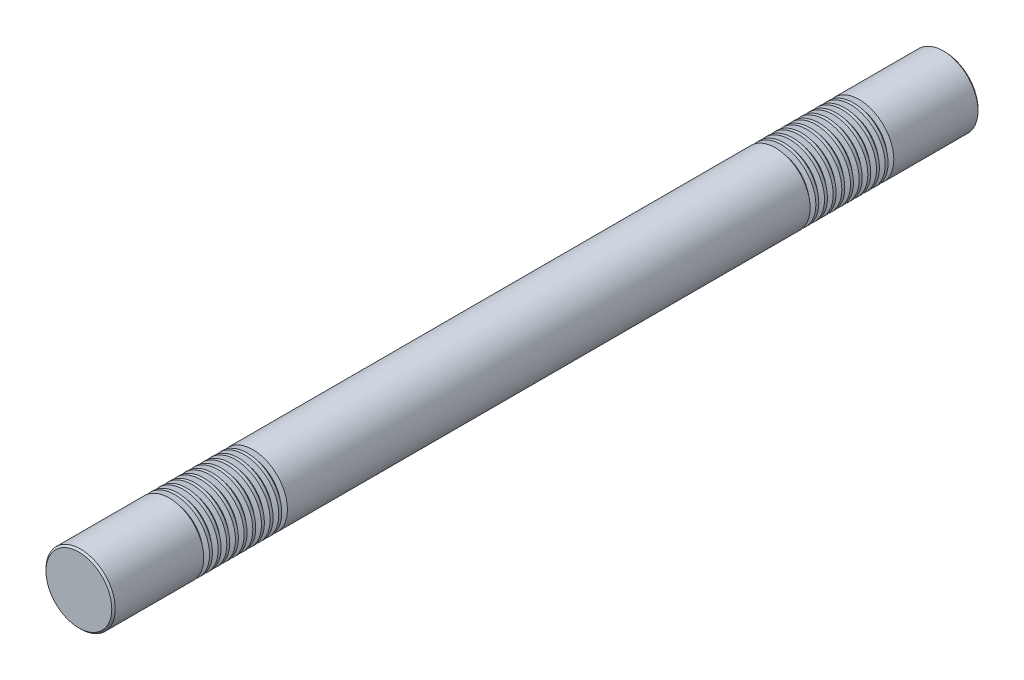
ISO-10303-21;
HEADER;
FILE_DESCRIPTION(('STEP AP214'),'2;1');
FILE_NAME('part.step','',(''),(''),'','','');
FILE_SCHEMA(('AUTOMOTIVE_DESIGN { 1 0 10303 214 1 1 1 1 }'));
ENDSEC;
DATA;
#1=APPLICATION_CONTEXT('core data for automotive mechanical design processes');
#2=APPLICATION_PROTOCOL_DEFINITION('international standard','automotive_design',2000,#1);
#3=PRODUCT_CONTEXT('',#1,'mechanical');
#4=PRODUCT('Part','Part','',(#3));
#5=PRODUCT_RELATED_PRODUCT_CATEGORY('part','',(#4));
#6=PRODUCT_DEFINITION_FORMATION('','',#4);
#7=PRODUCT_DEFINITION_CONTEXT('part definition',#1,'design');
#8=PRODUCT_DEFINITION('design','',#6,#7);
#9=PRODUCT_DEFINITION_SHAPE('','',#8);
#10=(LENGTH_UNIT() NAMED_UNIT(*) SI_UNIT(.MILLI.,.METRE.));
#11=(NAMED_UNIT(*) PLANE_ANGLE_UNIT() SI_UNIT($,.RADIAN.));
#12=(NAMED_UNIT(*) SI_UNIT($,.STERADIAN.) SOLID_ANGLE_UNIT());
#13=UNCERTAINTY_MEASURE_WITH_UNIT(LENGTH_MEASURE(1.E-05),#10,'distance_accuracy_value','');
#14=(GEOMETRIC_REPRESENTATION_CONTEXT(3) GLOBAL_UNCERTAINTY_ASSIGNED_CONTEXT((#13)) GLOBAL_UNIT_ASSIGNED_CONTEXT((#10,
#11,#12)) REPRESENTATION_CONTEXT('',''));
#15=CARTESIAN_POINT('',(0.,0.,0.));
#16=DIRECTION('',(0.,0.,1.));
#17=DIRECTION('',(1.,0.,0.));
#18=AXIS2_PLACEMENT_3D('',#15,#16,#17);
#19=CARTESIAN_POINT('',(0.,0.,500.));
#20=DIRECTION('',(0.,0.,-1.));
#21=DIRECTION('',(-1.,0.,0.));
#22=AXIS2_PLACEMENT_3D('',#19,#20,#21);
#23=CYLINDRICAL_SURFACE('',#22,40.);
#24=CARTESIAN_POINT('',(0.,0.,385.803847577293));
#25=DIRECTION('',(0.,0.,1.));
#26=DIRECTION('',(1.,0.,0.));
#27=AXIS2_PLACEMENT_3D('',#24,#25,#26);
#28=CIRCLE('',#27,40.);
#29=CARTESIAN_POINT('',(40.,0.,385.803847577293));
#30=VERTEX_POINT('',#29);
#31=EDGE_CURVE('E354',#30,#30,#28,.T.);
#32=ORIENTED_EDGE('',*,*,#31,.T.);
#33=EDGE_LOOP('',(#32));
#34=FACE_BOUND('',#33,.T.);
#35=CARTESIAN_POINT('',(0.,0.,389.196152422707));
#36=DIRECTION('',(0.,0.,1.));
#37=DIRECTION('',(1.,0.,0.));
#38=AXIS2_PLACEMENT_3D('',#35,#36,#37);
#39=CIRCLE('',#38,40.);
#40=CARTESIAN_POINT('',(40.,0.,389.196152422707));
#41=VERTEX_POINT('',#40);
#42=EDGE_CURVE('E366',#41,#41,#39,.T.);
#43=ORIENTED_EDGE('',*,*,#42,.F.);
#44=EDGE_LOOP('',(#43));
#45=FACE_BOUND('',#44,.T.);
#46=ADVANCED_FACE('F37',(#34,#45),#23,.T.);
#47=CARTESIAN_POINT('',(0.,0.,375.803847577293));
#48=DIRECTION('',(0.,0.,1.));
#49=DIRECTION('',(1.,0.,0.));
#50=AXIS2_PLACEMENT_3D('',#47,#48,#49);
#51=CIRCLE('',#50,40.);
#52=CARTESIAN_POINT('',(40.,0.,375.803847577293));
#53=VERTEX_POINT('',#52);
#54=EDGE_CURVE('E339',#53,#53,#51,.T.);
#55=ORIENTED_EDGE('',*,*,#54,.T.);
#56=EDGE_LOOP('',(#55));
#57=FACE_BOUND('',#56,.T.);
#58=CARTESIAN_POINT('',(0.,0.,379.196152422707));
#59=DIRECTION('',(0.,0.,1.));
#60=DIRECTION('',(1.,0.,0.));
#61=AXIS2_PLACEMENT_3D('',#58,#59,#60);
#62=CIRCLE('',#61,40.);
#63=CARTESIAN_POINT('',(40.,0.,379.196152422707));
#64=VERTEX_POINT('',#63);
#65=EDGE_CURVE('E351',#64,#64,#62,.T.);
#66=ORIENTED_EDGE('',*,*,#65,.F.);
#67=EDGE_LOOP('',(#66));
#68=FACE_BOUND('',#67,.T.);
#69=ADVANCED_FACE('F401',(#57,#68),#23,.T.);
#70=CARTESIAN_POINT('',(0.,0.,365.803847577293));
#71=DIRECTION('',(0.,0.,1.));
#72=DIRECTION('',(1.,0.,0.));
#73=AXIS2_PLACEMENT_3D('',#70,#71,#72);
#74=CIRCLE('',#73,40.);
#75=CARTESIAN_POINT('',(40.,0.,365.803847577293));
#76=VERTEX_POINT('',#75);
#77=EDGE_CURVE('E324',#76,#76,#74,.T.);
#78=ORIENTED_EDGE('',*,*,#77,.T.);
#79=EDGE_LOOP('',(#78));
#80=FACE_BOUND('',#79,.T.);
#81=CARTESIAN_POINT('',(0.,0.,369.196152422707));
#82=DIRECTION('',(0.,0.,1.));
#83=DIRECTION('',(1.,0.,0.));
#84=AXIS2_PLACEMENT_3D('',#81,#82,#83);
#85=CIRCLE('',#84,40.);
#86=CARTESIAN_POINT('',(40.,0.,369.196152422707));
#87=VERTEX_POINT('',#86);
#88=EDGE_CURVE('E335',#87,#87,#85,.T.);
#89=ORIENTED_EDGE('',*,*,#88,.F.);
#90=EDGE_LOOP('',(#89));
#91=FACE_BOUND('',#90,.T.);
#92=ADVANCED_FACE('F409',(#80,#91),#23,.T.);
#93=CARTESIAN_POINT('',(0.,0.,355.803847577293));
#94=DIRECTION('',(0.,0.,1.));
#95=DIRECTION('',(1.,0.,0.));
#96=AXIS2_PLACEMENT_3D('',#93,#94,#95);
#97=CIRCLE('',#96,40.);
#98=CARTESIAN_POINT('',(40.,0.,355.803847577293));
#99=VERTEX_POINT('',#98);
#100=EDGE_CURVE('E308',#99,#99,#97,.T.);
#101=ORIENTED_EDGE('',*,*,#100,.T.);
#102=EDGE_LOOP('',(#101));
#103=FACE_BOUND('',#102,.T.);
#104=CARTESIAN_POINT('',(0.,0.,359.196152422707));
#105=DIRECTION('',(0.,0.,1.));
#106=DIRECTION('',(1.,0.,0.));
#107=AXIS2_PLACEMENT_3D('',#104,#105,#106);
#108=CIRCLE('',#107,40.);
#109=CARTESIAN_POINT('',(40.,0.,359.196152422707));
#110=VERTEX_POINT('',#109);
#111=EDGE_CURVE('E320',#110,#110,#108,.T.);
#112=ORIENTED_EDGE('',*,*,#111,.F.);
#113=EDGE_LOOP('',(#112));
#114=FACE_BOUND('',#113,.T.);
#115=ADVANCED_FACE('F770',(#103,#114),#23,.T.);
#116=CARTESIAN_POINT('',(0.,0.,345.803847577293));
#117=DIRECTION('',(0.,0.,1.));
#118=DIRECTION('',(1.,0.,0.));
#119=AXIS2_PLACEMENT_3D('',#116,#117,#118);
#120=CIRCLE('',#119,40.);
#121=CARTESIAN_POINT('',(40.,0.,345.803847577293));
#122=VERTEX_POINT('',#121);
#123=EDGE_CURVE('E292',#122,#122,#120,.T.);
#124=ORIENTED_EDGE('',*,*,#123,.T.);
#125=EDGE_LOOP('',(#124));
#126=FACE_BOUND('',#125,.T.);
#127=CARTESIAN_POINT('',(0.,0.,349.196152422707));
#128=DIRECTION('',(0.,0.,1.));
#129=DIRECTION('',(1.,0.,0.));
#130=AXIS2_PLACEMENT_3D('',#127,#128,#129);
#131=CIRCLE('',#130,40.);
#132=CARTESIAN_POINT('',(40.,0.,349.196152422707));
#133=VERTEX_POINT('',#132);
#134=EDGE_CURVE('E304',#133,#133,#131,.T.);
#135=ORIENTED_EDGE('',*,*,#134,.F.);
#136=EDGE_LOOP('',(#135));
#137=FACE_BOUND('',#136,.T.);
#138=ADVANCED_FACE('F747',(#126,#137),#23,.T.);
#139=CARTESIAN_POINT('',(0.,0.,335.803847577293));
#140=DIRECTION('',(0.,0.,1.));
#141=DIRECTION('',(1.,0.,0.));
#142=AXIS2_PLACEMENT_3D('',#139,#140,#141);
#143=CIRCLE('',#142,40.);
#144=CARTESIAN_POINT('',(40.,0.,335.803847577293));
#145=VERTEX_POINT('',#144);
#146=EDGE_CURVE('E276',#145,#145,#143,.T.);
#147=ORIENTED_EDGE('',*,*,#146,.T.);
#148=EDGE_LOOP('',(#147));
#149=FACE_BOUND('',#148,.T.);
#150=CARTESIAN_POINT('',(0.,0.,339.196152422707));
#151=DIRECTION('',(0.,0.,1.));
#152=DIRECTION('',(1.,0.,0.));
#153=AXIS2_PLACEMENT_3D('',#150,#151,#152);
#154=CIRCLE('',#153,40.);
#155=CARTESIAN_POINT('',(40.,0.,339.196152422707));
#156=VERTEX_POINT('',#155);
#157=EDGE_CURVE('E288',#156,#156,#154,.T.);
#158=ORIENTED_EDGE('',*,*,#157,.F.);
#159=EDGE_LOOP('',(#158));
#160=FACE_BOUND('',#159,.T.);
#161=ADVANCED_FACE('F724',(#149,#160),#23,.T.);
#162=CARTESIAN_POINT('',(0.,0.,325.803847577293));
#163=DIRECTION('',(0.,0.,1.));
#164=DIRECTION('',(1.,0.,0.));
#165=AXIS2_PLACEMENT_3D('',#162,#163,#164);
#166=CIRCLE('',#165,40.);
#167=CARTESIAN_POINT('',(40.,0.,325.803847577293));
#168=VERTEX_POINT('',#167);
#169=EDGE_CURVE('E260',#168,#168,#166,.T.);
#170=ORIENTED_EDGE('',*,*,#169,.T.);
#171=EDGE_LOOP('',(#170));
#172=FACE_BOUND('',#171,.T.);
#173=CARTESIAN_POINT('',(0.,0.,329.196152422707));
#174=DIRECTION('',(0.,0.,1.));
#175=DIRECTION('',(1.,0.,0.));
#176=AXIS2_PLACEMENT_3D('',#173,#174,#175);
#177=CIRCLE('',#176,40.);
#178=CARTESIAN_POINT('',(40.,0.,329.196152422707));
#179=VERTEX_POINT('',#178);
#180=EDGE_CURVE('E272',#179,#179,#177,.T.);
#181=ORIENTED_EDGE('',*,*,#180,.F.);
#182=EDGE_LOOP('',(#181));
#183=FACE_BOUND('',#182,.T.);
#184=ADVANCED_FACE('F701',(#172,#183),#23,.T.);
#185=CARTESIAN_POINT('',(0.,0.,315.803847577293));
#186=DIRECTION('',(0.,0.,1.));
#187=DIRECTION('',(1.,0.,0.));
#188=AXIS2_PLACEMENT_3D('',#185,#186,#187);
#189=CIRCLE('',#188,40.);
#190=CARTESIAN_POINT('',(40.,0.,315.803847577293));
#191=VERTEX_POINT('',#190);
#192=EDGE_CURVE('E244',#191,#191,#189,.T.);
#193=ORIENTED_EDGE('',*,*,#192,.T.);
#194=EDGE_LOOP('',(#193));
#195=FACE_BOUND('',#194,.T.);
#196=CARTESIAN_POINT('',(0.,0.,319.196152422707));
#197=DIRECTION('',(0.,0.,1.));
#198=DIRECTION('',(1.,0.,0.));
#199=AXIS2_PLACEMENT_3D('',#196,#197,#198);
#200=CIRCLE('',#199,40.);
#201=CARTESIAN_POINT('',(40.,0.,319.196152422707));
#202=VERTEX_POINT('',#201);
#203=EDGE_CURVE('E256',#202,#202,#200,.T.);
#204=ORIENTED_EDGE('',*,*,#203,.F.);
#205=EDGE_LOOP('',(#204));
#206=FACE_BOUND('',#205,.T.);
#207=ADVANCED_FACE('F678',(#195,#206),#23,.T.);
#208=CARTESIAN_POINT('',(0.,0.,305.803847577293));
#209=DIRECTION('',(0.,0.,1.));
#210=DIRECTION('',(1.,0.,0.));
#211=AXIS2_PLACEMENT_3D('',#208,#209,#210);
#212=CIRCLE('',#211,40.);
#213=CARTESIAN_POINT('',(40.,0.,305.803847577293));
#214=VERTEX_POINT('',#213);
#215=EDGE_CURVE('E228',#214,#214,#212,.T.);
#216=ORIENTED_EDGE('',*,*,#215,.T.);
#217=EDGE_LOOP('',(#216));
#218=FACE_BOUND('',#217,.T.);
#219=CARTESIAN_POINT('',(0.,0.,309.196152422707));
#220=DIRECTION('',(0.,0.,1.));
#221=DIRECTION('',(1.,0.,0.));
#222=AXIS2_PLACEMENT_3D('',#219,#220,#221);
#223=CIRCLE('',#222,40.);
#224=CARTESIAN_POINT('',(40.,0.,309.196152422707));
#225=VERTEX_POINT('',#224);
#226=EDGE_CURVE('E240',#225,#225,#223,.T.);
#227=ORIENTED_EDGE('',*,*,#226,.F.);
#228=EDGE_LOOP('',(#227));
#229=FACE_BOUND('',#228,.T.);
#230=ADVANCED_FACE('F655',(#218,#229),#23,.T.);
#231=CARTESIAN_POINT('',(0.,0.,-304.196152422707));
#232=DIRECTION('',(0.,0.,1.));
#233=DIRECTION('',(1.,0.,0.));
#234=AXIS2_PLACEMENT_3D('',#231,#232,#233);
#235=CIRCLE('',#234,40.);
#236=CARTESIAN_POINT('',(40.,0.,-304.196152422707));
#237=VERTEX_POINT('',#236);
#238=EDGE_CURVE('E212',#237,#237,#235,.T.);
#239=ORIENTED_EDGE('',*,*,#238,.T.);
#240=EDGE_LOOP('',(#239));
#241=FACE_BOUND('',#240,.T.);
#242=CARTESIAN_POINT('',(0.,0.,299.196152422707));
#243=DIRECTION('',(0.,0.,1.));
#244=DIRECTION('',(1.,0.,0.));
#245=AXIS2_PLACEMENT_3D('',#242,#243,#244);
#246=CIRCLE('',#245,40.);
#247=CARTESIAN_POINT('',(40.,0.,299.196152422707));
#248=VERTEX_POINT('',#247);
#249=EDGE_CURVE('E224',#248,#248,#246,.T.);
#250=ORIENTED_EDGE('',*,*,#249,.F.);
#251=EDGE_LOOP('',(#250));
#252=FACE_BOUND('',#251,.T.);
#253=ADVANCED_FACE('F632',(#241,#252),#23,.T.);
#254=CARTESIAN_POINT('',(0.,0.,-314.196152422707));
#255=DIRECTION('',(0.,0.,1.));
#256=DIRECTION('',(1.,0.,0.));
#257=AXIS2_PLACEMENT_3D('',#254,#255,#256);
#258=CIRCLE('',#257,40.);
#259=CARTESIAN_POINT('',(40.,0.,-314.196152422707));
#260=VERTEX_POINT('',#259);
#261=EDGE_CURVE('E196',#260,#260,#258,.T.);
#262=ORIENTED_EDGE('',*,*,#261,.T.);
#263=EDGE_LOOP('',(#262));
#264=FACE_BOUND('',#263,.T.);
#265=CARTESIAN_POINT('',(0.,0.,-310.803847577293));
#266=DIRECTION('',(0.,0.,1.));
#267=DIRECTION('',(1.,0.,0.));
#268=AXIS2_PLACEMENT_3D('',#265,#266,#267);
#269=CIRCLE('',#268,40.);
#270=CARTESIAN_POINT('',(40.,0.,-310.803847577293));
#271=VERTEX_POINT('',#270);
#272=EDGE_CURVE('E208',#271,#271,#269,.T.);
#273=ORIENTED_EDGE('',*,*,#272,.F.);
#274=EDGE_LOOP('',(#273));
#275=FACE_BOUND('',#274,.T.);
#276=ADVANCED_FACE('F609',(#264,#275),#23,.T.);
#277=CARTESIAN_POINT('',(0.,0.,-324.196152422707));
#278=DIRECTION('',(0.,0.,1.));
#279=DIRECTION('',(1.,0.,0.));
#280=AXIS2_PLACEMENT_3D('',#277,#278,#279);
#281=CIRCLE('',#280,40.);
#282=CARTESIAN_POINT('',(40.,0.,-324.196152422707));
#283=VERTEX_POINT('',#282);
#284=EDGE_CURVE('E180',#283,#283,#281,.T.);
#285=ORIENTED_EDGE('',*,*,#284,.T.);
#286=EDGE_LOOP('',(#285));
#287=FACE_BOUND('',#286,.T.);
#288=CARTESIAN_POINT('',(0.,0.,-320.803847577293));
#289=DIRECTION('',(0.,0.,1.));
#290=DIRECTION('',(1.,0.,0.));
#291=AXIS2_PLACEMENT_3D('',#288,#289,#290);
#292=CIRCLE('',#291,40.);
#293=CARTESIAN_POINT('',(40.,0.,-320.803847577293));
#294=VERTEX_POINT('',#293);
#295=EDGE_CURVE('E192',#294,#294,#292,.T.);
#296=ORIENTED_EDGE('',*,*,#295,.F.);
#297=EDGE_LOOP('',(#296));
#298=FACE_BOUND('',#297,.T.);
#299=ADVANCED_FACE('F586',(#287,#298),#23,.T.);
#300=CARTESIAN_POINT('',(0.,0.,-334.196152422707));
#301=DIRECTION('',(0.,0.,1.));
#302=DIRECTION('',(1.,0.,0.));
#303=AXIS2_PLACEMENT_3D('',#300,#301,#302);
#304=CIRCLE('',#303,40.);
#305=CARTESIAN_POINT('',(40.,0.,-334.196152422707));
#306=VERTEX_POINT('',#305);
#307=EDGE_CURVE('E164',#306,#306,#304,.T.);
#308=ORIENTED_EDGE('',*,*,#307,.T.);
#309=EDGE_LOOP('',(#308));
#310=FACE_BOUND('',#309,.T.);
#311=CARTESIAN_POINT('',(0.,0.,-330.803847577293));
#312=DIRECTION('',(0.,0.,1.));
#313=DIRECTION('',(1.,0.,0.));
#314=AXIS2_PLACEMENT_3D('',#311,#312,#313);
#315=CIRCLE('',#314,40.);
#316=CARTESIAN_POINT('',(40.,0.,-330.803847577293));
#317=VERTEX_POINT('',#316);
#318=EDGE_CURVE('E176',#317,#317,#315,.T.);
#319=ORIENTED_EDGE('',*,*,#318,.F.);
#320=EDGE_LOOP('',(#319));
#321=FACE_BOUND('',#320,.T.);
#322=ADVANCED_FACE('F563',(#310,#321),#23,.T.);
#323=CARTESIAN_POINT('',(0.,0.,-344.196152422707));
#324=DIRECTION('',(0.,0.,1.));
#325=DIRECTION('',(1.,0.,0.));
#326=AXIS2_PLACEMENT_3D('',#323,#324,#325);
#327=CIRCLE('',#326,40.);
#328=CARTESIAN_POINT('',(40.,0.,-344.196152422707));
#329=VERTEX_POINT('',#328);
#330=EDGE_CURVE('E149',#329,#329,#327,.T.);
#331=ORIENTED_EDGE('',*,*,#330,.T.);
#332=EDGE_LOOP('',(#331));
#333=FACE_BOUND('',#332,.T.);
#334=CARTESIAN_POINT('',(0.,0.,-340.803847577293));
#335=DIRECTION('',(0.,0.,1.));
#336=DIRECTION('',(1.,0.,0.));
#337=AXIS2_PLACEMENT_3D('',#334,#335,#336);
#338=CIRCLE('',#337,40.);
#339=CARTESIAN_POINT('',(40.,0.,-340.803847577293));
#340=VERTEX_POINT('',#339);
#341=EDGE_CURVE('E160',#340,#340,#338,.T.);
#342=ORIENTED_EDGE('',*,*,#341,.F.);
#343=EDGE_LOOP('',(#342));
#344=FACE_BOUND('',#343,.T.);
#345=ADVANCED_FACE('F540',(#333,#344),#23,.T.);
#346=CARTESIAN_POINT('',(0.,0.,-354.196152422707));
#347=DIRECTION('',(0.,0.,1.));
#348=DIRECTION('',(1.,0.,0.));
#349=AXIS2_PLACEMENT_3D('',#346,#347,#348);
#350=CIRCLE('',#349,40.);
#351=CARTESIAN_POINT('',(40.,0.,-354.196152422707));
#352=VERTEX_POINT('',#351);
#353=EDGE_CURVE('E133',#352,#352,#350,.T.);
#354=ORIENTED_EDGE('',*,*,#353,.T.);
#355=EDGE_LOOP('',(#354));
#356=FACE_BOUND('',#355,.T.);
#357=CARTESIAN_POINT('',(0.,0.,-350.803847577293));
#358=DIRECTION('',(0.,0.,1.));
#359=DIRECTION('',(1.,0.,0.));
#360=AXIS2_PLACEMENT_3D('',#357,#358,#359);
#361=CIRCLE('',#360,40.);
#362=CARTESIAN_POINT('',(40.,0.,-350.803847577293));
#363=VERTEX_POINT('',#362);
#364=EDGE_CURVE('E145',#363,#363,#361,.T.);
#365=ORIENTED_EDGE('',*,*,#364,.F.);
#366=EDGE_LOOP('',(#365));
#367=FACE_BOUND('',#366,.T.);
#368=ADVANCED_FACE('F517',(#356,#367),#23,.T.);
#369=CARTESIAN_POINT('',(0.,0.,-364.196152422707));
#370=DIRECTION('',(0.,0.,1.));
#371=DIRECTION('',(1.,0.,0.));
#372=AXIS2_PLACEMENT_3D('',#369,#370,#371);
#373=CIRCLE('',#372,40.);
#374=CARTESIAN_POINT('',(40.,0.,-364.196152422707));
#375=VERTEX_POINT('',#374);
#376=EDGE_CURVE('E117',#375,#375,#373,.T.);
#377=ORIENTED_EDGE('',*,*,#376,.T.);
#378=EDGE_LOOP('',(#377));
#379=FACE_BOUND('',#378,.T.);
#380=CARTESIAN_POINT('',(0.,0.,-360.803847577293));
#381=DIRECTION('',(0.,0.,1.));
#382=DIRECTION('',(1.,0.,0.));
#383=AXIS2_PLACEMENT_3D('',#380,#381,#382);
#384=CIRCLE('',#383,40.);
#385=CARTESIAN_POINT('',(40.,0.,-360.803847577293));
#386=VERTEX_POINT('',#385);
#387=EDGE_CURVE('E129',#386,#386,#384,.T.);
#388=ORIENTED_EDGE('',*,*,#387,.F.);
#389=EDGE_LOOP('',(#388));
#390=FACE_BOUND('',#389,.T.);
#391=ADVANCED_FACE('F494',(#379,#390),#23,.T.);
#392=CARTESIAN_POINT('',(0.,0.,-374.196152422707));
#393=DIRECTION('',(0.,0.,1.));
#394=DIRECTION('',(1.,0.,0.));
#395=AXIS2_PLACEMENT_3D('',#392,#393,#394);
#396=CIRCLE('',#395,40.);
#397=CARTESIAN_POINT('',(40.,0.,-374.196152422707));
#398=VERTEX_POINT('',#397);
#399=EDGE_CURVE('E101',#398,#398,#396,.T.);
#400=ORIENTED_EDGE('',*,*,#399,.T.);
#401=EDGE_LOOP('',(#400));
#402=FACE_BOUND('',#401,.T.);
#403=CARTESIAN_POINT('',(0.,0.,-370.803847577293));
#404=DIRECTION('',(0.,0.,1.));
#405=DIRECTION('',(1.,0.,0.));
#406=AXIS2_PLACEMENT_3D('',#403,#404,#405);
#407=CIRCLE('',#406,40.);
#408=CARTESIAN_POINT('',(40.,0.,-370.803847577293));
#409=VERTEX_POINT('',#408);
#410=EDGE_CURVE('E113',#409,#409,#407,.T.);
#411=ORIENTED_EDGE('',*,*,#410,.F.);
#412=EDGE_LOOP('',(#411));
#413=FACE_BOUND('',#412,.T.);
#414=ADVANCED_FACE('F471',(#402,#413),#23,.T.);
#415=CARTESIAN_POINT('',(0.,0.,-384.196152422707));
#416=DIRECTION('',(0.,0.,1.));
#417=DIRECTION('',(1.,0.,0.));
#418=AXIS2_PLACEMENT_3D('',#415,#416,#417);
#419=CIRCLE('',#418,40.);
#420=CARTESIAN_POINT('',(40.,0.,-384.196152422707));
#421=VERTEX_POINT('',#420);
#422=EDGE_CURVE('E85',#421,#421,#419,.T.);
#423=ORIENTED_EDGE('',*,*,#422,.T.);
#424=EDGE_LOOP('',(#423));
#425=FACE_BOUND('',#424,.T.);
#426=CARTESIAN_POINT('',(0.,0.,-380.803847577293));
#427=DIRECTION('',(0.,0.,1.));
#428=DIRECTION('',(1.,0.,0.));
#429=AXIS2_PLACEMENT_3D('',#426,#427,#428);
#430=CIRCLE('',#429,40.);
#431=CARTESIAN_POINT('',(40.,0.,-380.803847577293));
#432=VERTEX_POINT('',#431);
#433=EDGE_CURVE('E97',#432,#432,#430,.T.);
#434=ORIENTED_EDGE('',*,*,#433,.F.);
#435=EDGE_LOOP('',(#434));
#436=FACE_BOUND('',#435,.T.);
#437=ADVANCED_FACE('F424',(#425,#436),#23,.T.);
#438=CARTESIAN_POINT('',(0.,0.,-394.196152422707));
#439=DIRECTION('',(0.,0.,1.));
#440=DIRECTION('',(1.,0.,0.));
#441=AXIS2_PLACEMENT_3D('',#438,#439,#440);
#442=CIRCLE('',#441,40.);
#443=CARTESIAN_POINT('',(40.,0.,-394.196152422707));
#444=VERTEX_POINT('',#443);
#445=EDGE_CURVE('E69',#444,#444,#442,.T.);
#446=ORIENTED_EDGE('',*,*,#445,.T.);
#447=EDGE_LOOP('',(#446));
#448=FACE_BOUND('',#447,.T.);
#449=CARTESIAN_POINT('',(0.,0.,-390.803847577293));
#450=DIRECTION('',(0.,0.,1.));
#451=DIRECTION('',(1.,0.,0.));
#452=AXIS2_PLACEMENT_3D('',#449,#450,#451);
#453=CIRCLE('',#452,40.);
#454=CARTESIAN_POINT('',(40.,0.,-390.803847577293));
#455=VERTEX_POINT('',#454);
#456=EDGE_CURVE('E81',#455,#455,#453,.T.);
#457=ORIENTED_EDGE('',*,*,#456,.F.);
#458=EDGE_LOOP('',(#457));
#459=FACE_BOUND('',#458,.T.);
#460=ADVANCED_FACE('F417',(#448,#459),#23,.T.);
#461=CARTESIAN_POINT('',(0.,0.,-498.));
#462=DIRECTION('',(0.,0.,1.));
#463=DIRECTION('',(1.,0.,0.));
#464=AXIS2_PLACEMENT_3D('',#461,#462,#463);
#465=CIRCLE('',#464,40.);
#466=CARTESIAN_POINT('',(40.,0.,-498.));
#467=VERTEX_POINT('',#466);
#468=EDGE_CURVE('E52',#467,#467,#465,.T.);
#469=ORIENTED_EDGE('',*,*,#468,.T.);
#470=EDGE_LOOP('',(#469));
#471=FACE_BOUND('',#470,.T.);
#472=CARTESIAN_POINT('',(0.,0.,-400.803847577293));
#473=DIRECTION('',(0.,0.,1.));
#474=DIRECTION('',(1.,0.,0.));
#475=AXIS2_PLACEMENT_3D('',#472,#473,#474);
#476=CIRCLE('',#475,40.);
#477=CARTESIAN_POINT('',(40.,0.,-400.803847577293));
#478=VERTEX_POINT('',#477);
#479=EDGE_CURVE('E65',#478,#478,#476,.T.);
#480=ORIENTED_EDGE('',*,*,#479,.F.);
#481=EDGE_LOOP('',(#480));
#482=FACE_BOUND('',#481,.T.);
#483=ADVANCED_FACE('F405',(#471,#482),#23,.T.);
#484=CARTESIAN_POINT('',(0.,0.,-500.));
#485=DIRECTION('',(0.,0.,1.));
#486=DIRECTION('',(1.,0.,0.));
#487=AXIS2_PLACEMENT_3D('',#484,#485,#486);
#488=PLANE('',#487);
#489=CARTESIAN_POINT('',(0.,0.,-500.));
#490=DIRECTION('',(0.,0.,1.));
#491=DIRECTION('',(1.,0.,0.));
#492=AXIS2_PLACEMENT_3D('',#489,#490,#491);
#493=CIRCLE('',#492,38.0000000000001);
#494=CARTESIAN_POINT('',(38.0000000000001,0.,-500.));
#495=VERTEX_POINT('',#494);
#496=EDGE_CURVE('E45',#495,#495,#493,.F.);
#497=ORIENTED_EDGE('',*,*,#496,.T.);
#498=EDGE_LOOP('',(#497));
#499=FACE_BOUND('',#498,.T.);
#500=ADVANCED_FACE('F416',(#499),#488,.F.);
#501=CARTESIAN_POINT('',(0.,0.,-498.));
#502=DIRECTION('',(0.,0.,1.));
#503=DIRECTION('',(1.,0.,0.));
#504=AXIS2_PLACEMENT_3D('',#501,#502,#503);
#505=CONICAL_SURFACE('',#504,40.,0.78539816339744);
#506=ORIENTED_EDGE('',*,*,#496,.F.);
#507=EDGE_LOOP('',(#506));
#508=FACE_BOUND('',#507,.T.);
#509=ORIENTED_EDGE('',*,*,#468,.F.);
#510=EDGE_LOOP('',(#509));
#511=FACE_BOUND('',#510,.T.);
#512=ADVANCED_FACE('F423',(#508,#511),#505,.T.);
#513=CARTESIAN_POINT('',(0.,0.,-399.196152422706));
#514=DIRECTION('',(0.,0.,-1.));
#515=DIRECTION('',(-1.,0.,0.));
#516=AXIS2_PLACEMENT_3D('',#513,#514,#515);
#517=CONICAL_SURFACE('',#516,34.,1.30899693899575);
#518=ORIENTED_EDGE('',*,*,#479,.T.);
#519=EDGE_LOOP('',(#518));
#520=FACE_BOUND('',#519,.T.);
#521=CARTESIAN_POINT('',(0.,0.,-399.196152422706));
#522=DIRECTION('',(0.,0.,1.));
#523=DIRECTION('',(1.,0.,0.));
#524=AXIS2_PLACEMENT_3D('',#521,#522,#523);
#525=CIRCLE('',#524,34.);
#526=CARTESIAN_POINT('',(34.,0.,-399.196152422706));
#527=VERTEX_POINT('',#526);
#528=EDGE_CURVE('E77',#527,#527,#525,.T.);
#529=ORIENTED_EDGE('',*,*,#528,.F.);
#530=EDGE_LOOP('',(#529));
#531=FACE_BOUND('',#530,.T.);
#532=ADVANCED_FACE('F430',(#520,#531),#517,.T.);
#533=CARTESIAN_POINT('',(0.,0.,-394.196152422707));
#534=DIRECTION('',(0.,0.,1.));
#535=DIRECTION('',(1.,0.,0.));
#536=AXIS2_PLACEMENT_3D('',#533,#534,#535);
#537=CONICAL_SURFACE('',#536,40.,1.30899693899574);
#538=CARTESIAN_POINT('',(0.,0.,-395.803847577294));
#539=DIRECTION('',(0.,0.,1.));
#540=DIRECTION('',(1.,0.,0.));
#541=AXIS2_PLACEMENT_3D('',#538,#539,#540);
#542=CIRCLE('',#541,34.);
#543=CARTESIAN_POINT('',(34.,0.,-395.803847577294));
#544=VERTEX_POINT('',#543);
#545=EDGE_CURVE('E73',#544,#544,#542,.T.);
#546=ORIENTED_EDGE('',*,*,#545,.T.);
#547=EDGE_LOOP('',(#546));
#548=FACE_BOUND('',#547,.T.);
#549=ORIENTED_EDGE('',*,*,#445,.F.);
#550=EDGE_LOOP('',(#549));
#551=FACE_BOUND('',#550,.T.);
#552=ADVANCED_FACE('F433',(#548,#551),#537,.T.);
#553=CARTESIAN_POINT('',(0.,0.,498.));
#554=DIRECTION('',(0.,0.,1.));
#555=DIRECTION('',(1.,0.,0.));
#556=AXIS2_PLACEMENT_3D('',#553,#554,#555);
#557=CYLINDRICAL_SURFACE('',#556,34.);
#558=ORIENTED_EDGE('',*,*,#528,.T.);
#559=EDGE_LOOP('',(#558));
#560=FACE_BOUND('',#559,.T.);
#561=ORIENTED_EDGE('',*,*,#545,.F.);
#562=EDGE_LOOP('',(#561));
#563=FACE_BOUND('',#562,.T.);
#564=ADVANCED_FACE('F437',(#560,#563),#557,.T.);
#565=CARTESIAN_POINT('',(0.,0.,-389.196152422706));
#566=DIRECTION('',(0.,0.,-1.));
#567=DIRECTION('',(-1.,0.,0.));
#568=AXIS2_PLACEMENT_3D('',#565,#566,#567);
#569=CONICAL_SURFACE('',#568,34.,1.30899693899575);
#570=ORIENTED_EDGE('',*,*,#456,.T.);
#571=EDGE_LOOP('',(#570));
#572=FACE_BOUND('',#571,.T.);
#573=CARTESIAN_POINT('',(0.,0.,-389.196152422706));
#574=DIRECTION('',(0.,0.,1.));
#575=DIRECTION('',(1.,0.,0.));
#576=AXIS2_PLACEMENT_3D('',#573,#574,#575);
#577=CIRCLE('',#576,34.);
#578=CARTESIAN_POINT('',(34.,0.,-389.196152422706));
#579=VERTEX_POINT('',#578);
#580=EDGE_CURVE('E93',#579,#579,#577,.T.);
#581=ORIENTED_EDGE('',*,*,#580,.F.);
#582=EDGE_LOOP('',(#581));
#583=FACE_BOUND('',#582,.T.);
#584=ADVANCED_FACE('F440',(#572,#583),#569,.T.);
#585=CARTESIAN_POINT('',(0.,0.,-384.196152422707));
#586=DIRECTION('',(0.,0.,1.));
#587=DIRECTION('',(1.,0.,0.));
#588=AXIS2_PLACEMENT_3D('',#585,#586,#587);
#589=CONICAL_SURFACE('',#588,40.,1.30899693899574);
#590=CARTESIAN_POINT('',(0.,0.,-385.803847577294));
#591=DIRECTION('',(0.,0.,1.));
#592=DIRECTION('',(1.,0.,0.));
#593=AXIS2_PLACEMENT_3D('',#590,#591,#592);
#594=CIRCLE('',#593,34.);
#595=CARTESIAN_POINT('',(34.,0.,-385.803847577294));
#596=VERTEX_POINT('',#595);
#597=EDGE_CURVE('E89',#596,#596,#594,.T.);
#598=ORIENTED_EDGE('',*,*,#597,.T.);
#599=EDGE_LOOP('',(#598));
#600=FACE_BOUND('',#599,.T.);
#601=ORIENTED_EDGE('',*,*,#422,.F.);
#602=EDGE_LOOP('',(#601));
#603=FACE_BOUND('',#602,.T.);
#604=ADVANCED_FACE('F453',(#600,#603),#589,.T.);
#605=CARTESIAN_POINT('',(0.,0.,-390.803847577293));
#606=DIRECTION('',(0.,0.,1.));
#607=DIRECTION('',(1.,0.,0.));
#608=AXIS2_PLACEMENT_3D('',#605,#606,#607);
#609=CYLINDRICAL_SURFACE('',#608,34.);
#610=ORIENTED_EDGE('',*,*,#580,.T.);
#611=EDGE_LOOP('',(#610));
#612=FACE_BOUND('',#611,.T.);
#613=ORIENTED_EDGE('',*,*,#597,.F.);
#614=EDGE_LOOP('',(#613));
#615=FACE_BOUND('',#614,.T.);
#616=ADVANCED_FACE('F457',(#612,#615),#609,.T.);
#617=CARTESIAN_POINT('',(0.,0.,-379.196152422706));
#618=DIRECTION('',(0.,0.,-1.));
#619=DIRECTION('',(-1.,0.,0.));
#620=AXIS2_PLACEMENT_3D('',#617,#618,#619);
#621=CONICAL_SURFACE('',#620,34.,1.30899693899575);
#622=ORIENTED_EDGE('',*,*,#433,.T.);
#623=EDGE_LOOP('',(#622));
#624=FACE_BOUND('',#623,.T.);
#625=CARTESIAN_POINT('',(0.,0.,-379.196152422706));
#626=DIRECTION('',(0.,0.,1.));
#627=DIRECTION('',(1.,0.,0.));
#628=AXIS2_PLACEMENT_3D('',#625,#626,#627);
#629=CIRCLE('',#628,34.);
#630=CARTESIAN_POINT('',(34.,0.,-379.196152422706));
#631=VERTEX_POINT('',#630);
#632=EDGE_CURVE('E109',#631,#631,#629,.T.);
#633=ORIENTED_EDGE('',*,*,#632,.F.);
#634=EDGE_LOOP('',(#633));
#635=FACE_BOUND('',#634,.T.);
#636=ADVANCED_FACE('F460',(#624,#635),#621,.T.);
#637=CARTESIAN_POINT('',(0.,0.,-374.196152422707));
#638=DIRECTION('',(0.,0.,1.));
#639=DIRECTION('',(1.,0.,0.));
#640=AXIS2_PLACEMENT_3D('',#637,#638,#639);
#641=CONICAL_SURFACE('',#640,40.,1.30899693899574);
#642=CARTESIAN_POINT('',(0.,0.,-375.803847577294));
#643=DIRECTION('',(0.,0.,1.));
#644=DIRECTION('',(1.,0.,0.));
#645=AXIS2_PLACEMENT_3D('',#642,#643,#644);
#646=CIRCLE('',#645,34.);
#647=CARTESIAN_POINT('',(34.,0.,-375.803847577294));
#648=VERTEX_POINT('',#647);
#649=EDGE_CURVE('E105',#648,#648,#646,.T.);
#650=ORIENTED_EDGE('',*,*,#649,.T.);
#651=EDGE_LOOP('',(#650));
#652=FACE_BOUND('',#651,.T.);
#653=ORIENTED_EDGE('',*,*,#399,.F.);
#654=EDGE_LOOP('',(#653));
#655=FACE_BOUND('',#654,.T.);
#656=ADVANCED_FACE('F476',(#652,#655),#641,.T.);
#657=CARTESIAN_POINT('',(0.,0.,-380.803847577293));
#658=DIRECTION('',(0.,0.,1.));
#659=DIRECTION('',(1.,0.,0.));
#660=AXIS2_PLACEMENT_3D('',#657,#658,#659);
#661=CYLINDRICAL_SURFACE('',#660,34.);
#662=ORIENTED_EDGE('',*,*,#632,.T.);
#663=EDGE_LOOP('',(#662));
#664=FACE_BOUND('',#663,.T.);
#665=ORIENTED_EDGE('',*,*,#649,.F.);
#666=EDGE_LOOP('',(#665));
#667=FACE_BOUND('',#666,.T.);
#668=ADVANCED_FACE('F480',(#664,#667),#661,.T.);
#669=CARTESIAN_POINT('',(0.,0.,-369.196152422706));
#670=DIRECTION('',(0.,0.,-1.));
#671=DIRECTION('',(-1.,0.,0.));
#672=AXIS2_PLACEMENT_3D('',#669,#670,#671);
#673=CONICAL_SURFACE('',#672,34.,1.30899693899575);
#674=ORIENTED_EDGE('',*,*,#410,.T.);
#675=EDGE_LOOP('',(#674));
#676=FACE_BOUND('',#675,.T.);
#677=CARTESIAN_POINT('',(0.,0.,-369.196152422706));
#678=DIRECTION('',(0.,0.,1.));
#679=DIRECTION('',(1.,0.,0.));
#680=AXIS2_PLACEMENT_3D('',#677,#678,#679);
#681=CIRCLE('',#680,34.);
#682=CARTESIAN_POINT('',(34.,0.,-369.196152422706));
#683=VERTEX_POINT('',#682);
#684=EDGE_CURVE('E125',#683,#683,#681,.T.);
#685=ORIENTED_EDGE('',*,*,#684,.F.);
#686=EDGE_LOOP('',(#685));
#687=FACE_BOUND('',#686,.T.);
#688=ADVANCED_FACE('F483',(#676,#687),#673,.T.);
#689=CARTESIAN_POINT('',(0.,0.,-364.196152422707));
#690=DIRECTION('',(0.,0.,1.));
#691=DIRECTION('',(1.,0.,0.));
#692=AXIS2_PLACEMENT_3D('',#689,#690,#691);
#693=CONICAL_SURFACE('',#692,40.,1.30899693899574);
#694=CARTESIAN_POINT('',(0.,0.,-365.803847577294));
#695=DIRECTION('',(0.,0.,1.));
#696=DIRECTION('',(1.,0.,0.));
#697=AXIS2_PLACEMENT_3D('',#694,#695,#696);
#698=CIRCLE('',#697,34.);
#699=CARTESIAN_POINT('',(34.,0.,-365.803847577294));
#700=VERTEX_POINT('',#699);
#701=EDGE_CURVE('E121',#700,#700,#698,.T.);
#702=ORIENTED_EDGE('',*,*,#701,.T.);
#703=EDGE_LOOP('',(#702));
#704=FACE_BOUND('',#703,.T.);
#705=ORIENTED_EDGE('',*,*,#376,.F.);
#706=EDGE_LOOP('',(#705));
#707=FACE_BOUND('',#706,.T.);
#708=ADVANCED_FACE('F499',(#704,#707),#693,.T.);
#709=CARTESIAN_POINT('',(0.,0.,-370.803847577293));
#710=DIRECTION('',(0.,0.,1.));
#711=DIRECTION('',(1.,0.,0.));
#712=AXIS2_PLACEMENT_3D('',#709,#710,#711);
#713=CYLINDRICAL_SURFACE('',#712,34.);
#714=ORIENTED_EDGE('',*,*,#684,.T.);
#715=EDGE_LOOP('',(#714));
#716=FACE_BOUND('',#715,.T.);
#717=ORIENTED_EDGE('',*,*,#701,.F.);
#718=EDGE_LOOP('',(#717));
#719=FACE_BOUND('',#718,.T.);
#720=ADVANCED_FACE('F503',(#716,#719),#713,.T.);
#721=CARTESIAN_POINT('',(0.,0.,-359.196152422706));
#722=DIRECTION('',(0.,0.,-1.));
#723=DIRECTION('',(-1.,0.,0.));
#724=AXIS2_PLACEMENT_3D('',#721,#722,#723);
#725=CONICAL_SURFACE('',#724,34.,1.30899693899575);
#726=ORIENTED_EDGE('',*,*,#387,.T.);
#727=EDGE_LOOP('',(#726));
#728=FACE_BOUND('',#727,.T.);
#729=CARTESIAN_POINT('',(0.,0.,-359.196152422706));
#730=DIRECTION('',(0.,0.,1.));
#731=DIRECTION('',(1.,0.,0.));
#732=AXIS2_PLACEMENT_3D('',#729,#730,#731);
#733=CIRCLE('',#732,34.);
#734=CARTESIAN_POINT('',(34.,0.,-359.196152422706));
#735=VERTEX_POINT('',#734);
#736=EDGE_CURVE('E141',#735,#735,#733,.T.);
#737=ORIENTED_EDGE('',*,*,#736,.F.);
#738=EDGE_LOOP('',(#737));
#739=FACE_BOUND('',#738,.T.);
#740=ADVANCED_FACE('F506',(#728,#739),#725,.T.);
#741=CARTESIAN_POINT('',(0.,0.,-354.196152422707));
#742=DIRECTION('',(0.,0.,1.));
#743=DIRECTION('',(1.,0.,0.));
#744=AXIS2_PLACEMENT_3D('',#741,#742,#743);
#745=CONICAL_SURFACE('',#744,40.,1.30899693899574);
#746=CARTESIAN_POINT('',(0.,0.,-355.803847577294));
#747=DIRECTION('',(0.,0.,1.));
#748=DIRECTION('',(1.,0.,0.));
#749=AXIS2_PLACEMENT_3D('',#746,#747,#748);
#750=CIRCLE('',#749,34.);
#751=CARTESIAN_POINT('',(34.,0.,-355.803847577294));
#752=VERTEX_POINT('',#751);
#753=EDGE_CURVE('E137',#752,#752,#750,.T.);
#754=ORIENTED_EDGE('',*,*,#753,.T.);
#755=EDGE_LOOP('',(#754));
#756=FACE_BOUND('',#755,.T.);
#757=ORIENTED_EDGE('',*,*,#353,.F.);
#758=EDGE_LOOP('',(#757));
#759=FACE_BOUND('',#758,.T.);
#760=ADVANCED_FACE('F522',(#756,#759),#745,.T.);
#761=CARTESIAN_POINT('',(0.,0.,-360.803847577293));
#762=DIRECTION('',(0.,0.,1.));
#763=DIRECTION('',(1.,0.,0.));
#764=AXIS2_PLACEMENT_3D('',#761,#762,#763);
#765=CYLINDRICAL_SURFACE('',#764,34.);
#766=ORIENTED_EDGE('',*,*,#736,.T.);
#767=EDGE_LOOP('',(#766));
#768=FACE_BOUND('',#767,.T.);
#769=ORIENTED_EDGE('',*,*,#753,.F.);
#770=EDGE_LOOP('',(#769));
#771=FACE_BOUND('',#770,.T.);
#772=ADVANCED_FACE('F526',(#768,#771),#765,.T.);
#773=CARTESIAN_POINT('',(0.,0.,-349.196152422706));
#774=DIRECTION('',(0.,0.,-1.));
#775=DIRECTION('',(-1.,0.,0.));
#776=AXIS2_PLACEMENT_3D('',#773,#774,#775);
#777=CONICAL_SURFACE('',#776,34.,1.30899693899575);
#778=ORIENTED_EDGE('',*,*,#364,.T.);
#779=EDGE_LOOP('',(#778));
#780=FACE_BOUND('',#779,.T.);
#781=CARTESIAN_POINT('',(0.,0.,-349.196152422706));
#782=DIRECTION('',(0.,0.,1.));
#783=DIRECTION('',(1.,0.,0.));
#784=AXIS2_PLACEMENT_3D('',#781,#782,#783);
#785=CIRCLE('',#784,34.);
#786=CARTESIAN_POINT('',(34.,0.,-349.196152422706));
#787=VERTEX_POINT('',#786);
#788=EDGE_CURVE('E156',#787,#787,#785,.T.);
#789=ORIENTED_EDGE('',*,*,#788,.F.);
#790=EDGE_LOOP('',(#789));
#791=FACE_BOUND('',#790,.T.);
#792=ADVANCED_FACE('F529',(#780,#791),#777,.T.);
#793=CARTESIAN_POINT('',(0.,0.,-344.196152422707));
#794=DIRECTION('',(0.,0.,1.));
#795=DIRECTION('',(1.,0.,0.));
#796=AXIS2_PLACEMENT_3D('',#793,#794,#795);
#797=CONICAL_SURFACE('',#796,40.,1.30899693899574);
#798=CARTESIAN_POINT('',(0.,0.,-345.803847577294));
#799=DIRECTION('',(0.,0.,1.));
#800=DIRECTION('',(1.,0.,0.));
#801=AXIS2_PLACEMENT_3D('',#798,#799,#800);
#802=CIRCLE('',#801,34.);
#803=CARTESIAN_POINT('',(34.,0.,-345.803847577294));
#804=VERTEX_POINT('',#803);
#805=EDGE_CURVE('E153',#804,#804,#802,.T.);
#806=ORIENTED_EDGE('',*,*,#805,.T.);
#807=EDGE_LOOP('',(#806));
#808=FACE_BOUND('',#807,.T.);
#809=ORIENTED_EDGE('',*,*,#330,.F.);
#810=EDGE_LOOP('',(#809));
#811=FACE_BOUND('',#810,.T.);
#812=ADVANCED_FACE('F545',(#808,#811),#797,.T.);
#813=CARTESIAN_POINT('',(0.,0.,-350.803847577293));
#814=DIRECTION('',(0.,0.,1.));
#815=DIRECTION('',(1.,0.,0.));
#816=AXIS2_PLACEMENT_3D('',#813,#814,#815);
#817=CYLINDRICAL_SURFACE('',#816,34.);
#818=ORIENTED_EDGE('',*,*,#788,.T.);
#819=EDGE_LOOP('',(#818));
#820=FACE_BOUND('',#819,.T.);
#821=ORIENTED_EDGE('',*,*,#805,.F.);
#822=EDGE_LOOP('',(#821));
#823=FACE_BOUND('',#822,.T.);
#824=ADVANCED_FACE('F549',(#820,#823),#817,.T.);
#825=CARTESIAN_POINT('',(0.,0.,-339.196152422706));
#826=DIRECTION('',(0.,0.,-1.));
#827=DIRECTION('',(-1.,0.,0.));
#828=AXIS2_PLACEMENT_3D('',#825,#826,#827);
#829=CONICAL_SURFACE('',#828,34.,1.30899693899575);
#830=ORIENTED_EDGE('',*,*,#341,.T.);
#831=EDGE_LOOP('',(#830));
#832=FACE_BOUND('',#831,.T.);
#833=CARTESIAN_POINT('',(0.,0.,-339.196152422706));
#834=DIRECTION('',(0.,0.,1.));
#835=DIRECTION('',(1.,0.,0.));
#836=AXIS2_PLACEMENT_3D('',#833,#834,#835);
#837=CIRCLE('',#836,34.);
#838=CARTESIAN_POINT('',(34.,0.,-339.196152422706));
#839=VERTEX_POINT('',#838);
#840=EDGE_CURVE('E172',#839,#839,#837,.T.);
#841=ORIENTED_EDGE('',*,*,#840,.F.);
#842=EDGE_LOOP('',(#841));
#843=FACE_BOUND('',#842,.T.);
#844=ADVANCED_FACE('F552',(#832,#843),#829,.T.);
#845=CARTESIAN_POINT('',(0.,0.,-334.196152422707));
#846=DIRECTION('',(0.,0.,1.));
#847=DIRECTION('',(1.,0.,0.));
#848=AXIS2_PLACEMENT_3D('',#845,#846,#847);
#849=CONICAL_SURFACE('',#848,40.,1.30899693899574);
#850=CARTESIAN_POINT('',(0.,0.,-335.803847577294));
#851=DIRECTION('',(0.,0.,1.));
#852=DIRECTION('',(1.,0.,0.));
#853=AXIS2_PLACEMENT_3D('',#850,#851,#852);
#854=CIRCLE('',#853,34.);
#855=CARTESIAN_POINT('',(34.,0.,-335.803847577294));
#856=VERTEX_POINT('',#855);
#857=EDGE_CURVE('E168',#856,#856,#854,.T.);
#858=ORIENTED_EDGE('',*,*,#857,.T.);
#859=EDGE_LOOP('',(#858));
#860=FACE_BOUND('',#859,.T.);
#861=ORIENTED_EDGE('',*,*,#307,.F.);
#862=EDGE_LOOP('',(#861));
#863=FACE_BOUND('',#862,.T.);
#864=ADVANCED_FACE('F568',(#860,#863),#849,.T.);
#865=CARTESIAN_POINT('',(0.,0.,-340.803847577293));
#866=DIRECTION('',(0.,0.,1.));
#867=DIRECTION('',(1.,0.,0.));
#868=AXIS2_PLACEMENT_3D('',#865,#866,#867);
#869=CYLINDRICAL_SURFACE('',#868,34.);
#870=ORIENTED_EDGE('',*,*,#840,.T.);
#871=EDGE_LOOP('',(#870));
#872=FACE_BOUND('',#871,.T.);
#873=ORIENTED_EDGE('',*,*,#857,.F.);
#874=EDGE_LOOP('',(#873));
#875=FACE_BOUND('',#874,.T.);
#876=ADVANCED_FACE('F572',(#872,#875),#869,.T.);
#877=CARTESIAN_POINT('',(0.,0.,-329.196152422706));
#878=DIRECTION('',(0.,0.,-1.));
#879=DIRECTION('',(-1.,0.,0.));
#880=AXIS2_PLACEMENT_3D('',#877,#878,#879);
#881=CONICAL_SURFACE('',#880,34.,1.30899693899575);
#882=ORIENTED_EDGE('',*,*,#318,.T.);
#883=EDGE_LOOP('',(#882));
#884=FACE_BOUND('',#883,.T.);
#885=CARTESIAN_POINT('',(0.,0.,-329.196152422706));
#886=DIRECTION('',(0.,0.,1.));
#887=DIRECTION('',(1.,0.,0.));
#888=AXIS2_PLACEMENT_3D('',#885,#886,#887);
#889=CIRCLE('',#888,34.);
#890=CARTESIAN_POINT('',(34.,0.,-329.196152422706));
#891=VERTEX_POINT('',#890);
#892=EDGE_CURVE('E188',#891,#891,#889,.T.);
#893=ORIENTED_EDGE('',*,*,#892,.F.);
#894=EDGE_LOOP('',(#893));
#895=FACE_BOUND('',#894,.T.);
#896=ADVANCED_FACE('F575',(#884,#895),#881,.T.);
#897=CARTESIAN_POINT('',(0.,0.,-324.196152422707));
#898=DIRECTION('',(0.,0.,1.));
#899=DIRECTION('',(1.,0.,0.));
#900=AXIS2_PLACEMENT_3D('',#897,#898,#899);
#901=CONICAL_SURFACE('',#900,40.,1.30899693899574);
#902=CARTESIAN_POINT('',(0.,0.,-325.803847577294));
#903=DIRECTION('',(0.,0.,1.));
#904=DIRECTION('',(1.,0.,0.));
#905=AXIS2_PLACEMENT_3D('',#902,#903,#904);
#906=CIRCLE('',#905,34.);
#907=CARTESIAN_POINT('',(34.,0.,-325.803847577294));
#908=VERTEX_POINT('',#907);
#909=EDGE_CURVE('E184',#908,#908,#906,.T.);
#910=ORIENTED_EDGE('',*,*,#909,.T.);
#911=EDGE_LOOP('',(#910));
#912=FACE_BOUND('',#911,.T.);
#913=ORIENTED_EDGE('',*,*,#284,.F.);
#914=EDGE_LOOP('',(#913));
#915=FACE_BOUND('',#914,.T.);
#916=ADVANCED_FACE('F591',(#912,#915),#901,.T.);
#917=CARTESIAN_POINT('',(0.,0.,-330.803847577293));
#918=DIRECTION('',(0.,0.,1.));
#919=DIRECTION('',(1.,0.,0.));
#920=AXIS2_PLACEMENT_3D('',#917,#918,#919);
#921=CYLINDRICAL_SURFACE('',#920,34.);
#922=ORIENTED_EDGE('',*,*,#892,.T.);
#923=EDGE_LOOP('',(#922));
#924=FACE_BOUND('',#923,.T.);
#925=ORIENTED_EDGE('',*,*,#909,.F.);
#926=EDGE_LOOP('',(#925));
#927=FACE_BOUND('',#926,.T.);
#928=ADVANCED_FACE('F595',(#924,#927),#921,.T.);
#929=CARTESIAN_POINT('',(0.,0.,-319.196152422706));
#930=DIRECTION('',(0.,0.,-1.));
#931=DIRECTION('',(-1.,0.,0.));
#932=AXIS2_PLACEMENT_3D('',#929,#930,#931);
#933=CONICAL_SURFACE('',#932,34.,1.30899693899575);
#934=ORIENTED_EDGE('',*,*,#295,.T.);
#935=EDGE_LOOP('',(#934));
#936=FACE_BOUND('',#935,.T.);
#937=CARTESIAN_POINT('',(0.,0.,-319.196152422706));
#938=DIRECTION('',(0.,0.,1.));
#939=DIRECTION('',(1.,0.,0.));
#940=AXIS2_PLACEMENT_3D('',#937,#938,#939);
#941=CIRCLE('',#940,34.);
#942=CARTESIAN_POINT('',(34.,0.,-319.196152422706));
#943=VERTEX_POINT('',#942);
#944=EDGE_CURVE('E204',#943,#943,#941,.T.);
#945=ORIENTED_EDGE('',*,*,#944,.F.);
#946=EDGE_LOOP('',(#945));
#947=FACE_BOUND('',#946,.T.);
#948=ADVANCED_FACE('F598',(#936,#947),#933,.T.);
#949=CARTESIAN_POINT('',(0.,0.,-314.196152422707));
#950=DIRECTION('',(0.,0.,1.));
#951=DIRECTION('',(1.,0.,0.));
#952=AXIS2_PLACEMENT_3D('',#949,#950,#951);
#953=CONICAL_SURFACE('',#952,40.,1.30899693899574);
#954=CARTESIAN_POINT('',(0.,0.,-315.803847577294));
#955=DIRECTION('',(0.,0.,1.));
#956=DIRECTION('',(1.,0.,0.));
#957=AXIS2_PLACEMENT_3D('',#954,#955,#956);
#958=CIRCLE('',#957,34.);
#959=CARTESIAN_POINT('',(34.,0.,-315.803847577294));
#960=VERTEX_POINT('',#959);
#961=EDGE_CURVE('E200',#960,#960,#958,.T.);
#962=ORIENTED_EDGE('',*,*,#961,.T.);
#963=EDGE_LOOP('',(#962));
#964=FACE_BOUND('',#963,.T.);
#965=ORIENTED_EDGE('',*,*,#261,.F.);
#966=EDGE_LOOP('',(#965));
#967=FACE_BOUND('',#966,.T.);
#968=ADVANCED_FACE('F614',(#964,#967),#953,.T.);
#969=CARTESIAN_POINT('',(0.,0.,-320.803847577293));
#970=DIRECTION('',(0.,0.,1.));
#971=DIRECTION('',(1.,0.,0.));
#972=AXIS2_PLACEMENT_3D('',#969,#970,#971);
#973=CYLINDRICAL_SURFACE('',#972,34.);
#974=ORIENTED_EDGE('',*,*,#944,.T.);
#975=EDGE_LOOP('',(#974));
#976=FACE_BOUND('',#975,.T.);
#977=ORIENTED_EDGE('',*,*,#961,.F.);
#978=EDGE_LOOP('',(#977));
#979=FACE_BOUND('',#978,.T.);
#980=ADVANCED_FACE('F618',(#976,#979),#973,.T.);
#981=CARTESIAN_POINT('',(0.,0.,-309.196152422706));
#982=DIRECTION('',(0.,0.,-1.));
#983=DIRECTION('',(-1.,0.,0.));
#984=AXIS2_PLACEMENT_3D('',#981,#982,#983);
#985=CONICAL_SURFACE('',#984,34.,1.30899693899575);
#986=ORIENTED_EDGE('',*,*,#272,.T.);
#987=EDGE_LOOP('',(#986));
#988=FACE_BOUND('',#987,.T.);
#989=CARTESIAN_POINT('',(0.,0.,-309.196152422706));
#990=DIRECTION('',(0.,0.,1.));
#991=DIRECTION('',(1.,0.,0.));
#992=AXIS2_PLACEMENT_3D('',#989,#990,#991);
#993=CIRCLE('',#992,34.);
#994=CARTESIAN_POINT('',(34.,0.,-309.196152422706));
#995=VERTEX_POINT('',#994);
#996=EDGE_CURVE('E220',#995,#995,#993,.T.);
#997=ORIENTED_EDGE('',*,*,#996,.F.);
#998=EDGE_LOOP('',(#997));
#999=FACE_BOUND('',#998,.T.);
#1000=ADVANCED_FACE('F621',(#988,#999),#985,.T.);
#1001=CARTESIAN_POINT('',(0.,0.,-304.196152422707));
#1002=DIRECTION('',(0.,0.,1.));
#1003=DIRECTION('',(1.,0.,0.));
#1004=AXIS2_PLACEMENT_3D('',#1001,#1002,#1003);
#1005=CONICAL_SURFACE('',#1004,40.,1.30899693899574);
#1006=CARTESIAN_POINT('',(0.,0.,-305.803847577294));
#1007=DIRECTION('',(0.,0.,1.));
#1008=DIRECTION('',(1.,0.,0.));
#1009=AXIS2_PLACEMENT_3D('',#1006,#1007,#1008);
#1010=CIRCLE('',#1009,34.);
#1011=CARTESIAN_POINT('',(34.,0.,-305.803847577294));
#1012=VERTEX_POINT('',#1011);
#1013=EDGE_CURVE('E216',#1012,#1012,#1010,.T.);
#1014=ORIENTED_EDGE('',*,*,#1013,.T.);
#1015=EDGE_LOOP('',(#1014));
#1016=FACE_BOUND('',#1015,.T.);
#1017=ORIENTED_EDGE('',*,*,#238,.F.);
#1018=EDGE_LOOP('',(#1017));
#1019=FACE_BOUND('',#1018,.T.);
#1020=ADVANCED_FACE('F637',(#1016,#1019),#1005,.T.);
#1021=CARTESIAN_POINT('',(0.,0.,-310.803847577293));
#1022=DIRECTION('',(0.,0.,1.));
#1023=DIRECTION('',(1.,0.,0.));
#1024=AXIS2_PLACEMENT_3D('',#1021,#1022,#1023);
#1025=CYLINDRICAL_SURFACE('',#1024,34.);
#1026=ORIENTED_EDGE('',*,*,#996,.T.);
#1027=EDGE_LOOP('',(#1026));
#1028=FACE_BOUND('',#1027,.T.);
#1029=ORIENTED_EDGE('',*,*,#1013,.F.);
#1030=EDGE_LOOP('',(#1029));
#1031=FACE_BOUND('',#1030,.T.);
#1032=ADVANCED_FACE('F641',(#1028,#1031),#1025,.T.);
#1033=CARTESIAN_POINT('',(0.,0.,300.803847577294));
#1034=DIRECTION('',(0.,0.,-1.));
#1035=DIRECTION('',(-1.,0.,0.));
#1036=AXIS2_PLACEMENT_3D('',#1033,#1034,#1035);
#1037=CONICAL_SURFACE('',#1036,34.,1.30899693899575);
#1038=ORIENTED_EDGE('',*,*,#249,.T.);
#1039=EDGE_LOOP('',(#1038));
#1040=FACE_BOUND('',#1039,.T.);
#1041=CARTESIAN_POINT('',(0.,0.,300.803847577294));
#1042=DIRECTION('',(0.,0.,1.));
#1043=DIRECTION('',(1.,0.,0.));
#1044=AXIS2_PLACEMENT_3D('',#1041,#1042,#1043);
#1045=CIRCLE('',#1044,34.);
#1046=CARTESIAN_POINT('',(34.,0.,300.803847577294));
#1047=VERTEX_POINT('',#1046);
#1048=EDGE_CURVE('E236',#1047,#1047,#1045,.T.);
#1049=ORIENTED_EDGE('',*,*,#1048,.F.);
#1050=EDGE_LOOP('',(#1049));
#1051=FACE_BOUND('',#1050,.T.);
#1052=ADVANCED_FACE('F644',(#1040,#1051),#1037,.T.);
#1053=CARTESIAN_POINT('',(0.,0.,305.803847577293));
#1054=DIRECTION('',(0.,0.,1.));
#1055=DIRECTION('',(1.,0.,0.));
#1056=AXIS2_PLACEMENT_3D('',#1053,#1054,#1055);
#1057=CONICAL_SURFACE('',#1056,40.,1.30899693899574);
#1058=CARTESIAN_POINT('',(0.,0.,304.196152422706));
#1059=DIRECTION('',(0.,0.,1.));
#1060=DIRECTION('',(1.,0.,0.));
#1061=AXIS2_PLACEMENT_3D('',#1058,#1059,#1060);
#1062=CIRCLE('',#1061,34.);
#1063=CARTESIAN_POINT('',(34.,0.,304.196152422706));
#1064=VERTEX_POINT('',#1063);
#1065=EDGE_CURVE('E232',#1064,#1064,#1062,.T.);
#1066=ORIENTED_EDGE('',*,*,#1065,.T.);
#1067=EDGE_LOOP('',(#1066));
#1068=FACE_BOUND('',#1067,.T.);
#1069=ORIENTED_EDGE('',*,*,#215,.F.);
#1070=EDGE_LOOP('',(#1069));
#1071=FACE_BOUND('',#1070,.T.);
#1072=ADVANCED_FACE('F660',(#1068,#1071),#1057,.T.);
#1073=CARTESIAN_POINT('',(0.,0.,299.196152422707));
#1074=DIRECTION('',(0.,0.,1.));
#1075=DIRECTION('',(1.,0.,0.));
#1076=AXIS2_PLACEMENT_3D('',#1073,#1074,#1075);
#1077=CYLINDRICAL_SURFACE('',#1076,34.);
#1078=ORIENTED_EDGE('',*,*,#1048,.T.);
#1079=EDGE_LOOP('',(#1078));
#1080=FACE_BOUND('',#1079,.T.);
#1081=ORIENTED_EDGE('',*,*,#1065,.F.);
#1082=EDGE_LOOP('',(#1081));
#1083=FACE_BOUND('',#1082,.T.);
#1084=ADVANCED_FACE('F664',(#1080,#1083),#1077,.T.);
#1085=CARTESIAN_POINT('',(0.,0.,310.803847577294));
#1086=DIRECTION('',(0.,0.,-1.));
#1087=DIRECTION('',(-1.,0.,0.));
#1088=AXIS2_PLACEMENT_3D('',#1085,#1086,#1087);
#1089=CONICAL_SURFACE('',#1088,34.,1.30899693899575);
#1090=ORIENTED_EDGE('',*,*,#226,.T.);
#1091=EDGE_LOOP('',(#1090));
#1092=FACE_BOUND('',#1091,.T.);
#1093=CARTESIAN_POINT('',(0.,0.,310.803847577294));
#1094=DIRECTION('',(0.,0.,1.));
#1095=DIRECTION('',(1.,0.,0.));
#1096=AXIS2_PLACEMENT_3D('',#1093,#1094,#1095);
#1097=CIRCLE('',#1096,34.);
#1098=CARTESIAN_POINT('',(34.,0.,310.803847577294));
#1099=VERTEX_POINT('',#1098);
#1100=EDGE_CURVE('E252',#1099,#1099,#1097,.T.);
#1101=ORIENTED_EDGE('',*,*,#1100,.F.);
#1102=EDGE_LOOP('',(#1101));
#1103=FACE_BOUND('',#1102,.T.);
#1104=ADVANCED_FACE('F667',(#1092,#1103),#1089,.T.);
#1105=CARTESIAN_POINT('',(0.,0.,315.803847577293));
#1106=DIRECTION('',(0.,0.,1.));
#1107=DIRECTION('',(1.,0.,0.));
#1108=AXIS2_PLACEMENT_3D('',#1105,#1106,#1107);
#1109=CONICAL_SURFACE('',#1108,40.,1.30899693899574);
#1110=CARTESIAN_POINT('',(0.,0.,314.196152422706));
#1111=DIRECTION('',(0.,0.,1.));
#1112=DIRECTION('',(1.,0.,0.));
#1113=AXIS2_PLACEMENT_3D('',#1110,#1111,#1112);
#1114=CIRCLE('',#1113,34.);
#1115=CARTESIAN_POINT('',(34.,0.,314.196152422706));
#1116=VERTEX_POINT('',#1115);
#1117=EDGE_CURVE('E248',#1116,#1116,#1114,.T.);
#1118=ORIENTED_EDGE('',*,*,#1117,.T.);
#1119=EDGE_LOOP('',(#1118));
#1120=FACE_BOUND('',#1119,.T.);
#1121=ORIENTED_EDGE('',*,*,#192,.F.);
#1122=EDGE_LOOP('',(#1121));
#1123=FACE_BOUND('',#1122,.T.);
#1124=ADVANCED_FACE('F683',(#1120,#1123),#1109,.T.);
#1125=CARTESIAN_POINT('',(0.,0.,309.196152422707));
#1126=DIRECTION('',(0.,0.,1.));
#1127=DIRECTION('',(1.,0.,0.));
#1128=AXIS2_PLACEMENT_3D('',#1125,#1126,#1127);
#1129=CYLINDRICAL_SURFACE('',#1128,34.);
#1130=ORIENTED_EDGE('',*,*,#1100,.T.);
#1131=EDGE_LOOP('',(#1130));
#1132=FACE_BOUND('',#1131,.T.);
#1133=ORIENTED_EDGE('',*,*,#1117,.F.);
#1134=EDGE_LOOP('',(#1133));
#1135=FACE_BOUND('',#1134,.T.);
#1136=ADVANCED_FACE('F687',(#1132,#1135),#1129,.T.);
#1137=CARTESIAN_POINT('',(0.,0.,320.803847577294));
#1138=DIRECTION('',(0.,0.,-1.));
#1139=DIRECTION('',(-1.,0.,0.));
#1140=AXIS2_PLACEMENT_3D('',#1137,#1138,#1139);
#1141=CONICAL_SURFACE('',#1140,34.,1.30899693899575);
#1142=ORIENTED_EDGE('',*,*,#203,.T.);
#1143=EDGE_LOOP('',(#1142));
#1144=FACE_BOUND('',#1143,.T.);
#1145=CARTESIAN_POINT('',(0.,0.,320.803847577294));
#1146=DIRECTION('',(0.,0.,1.));
#1147=DIRECTION('',(1.,0.,0.));
#1148=AXIS2_PLACEMENT_3D('',#1145,#1146,#1147);
#1149=CIRCLE('',#1148,34.);
#1150=CARTESIAN_POINT('',(34.,0.,320.803847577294));
#1151=VERTEX_POINT('',#1150);
#1152=EDGE_CURVE('E268',#1151,#1151,#1149,.T.);
#1153=ORIENTED_EDGE('',*,*,#1152,.F.);
#1154=EDGE_LOOP('',(#1153));
#1155=FACE_BOUND('',#1154,.T.);
#1156=ADVANCED_FACE('F690',(#1144,#1155),#1141,.T.);
#1157=CARTESIAN_POINT('',(0.,0.,325.803847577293));
#1158=DIRECTION('',(0.,0.,1.));
#1159=DIRECTION('',(1.,0.,0.));
#1160=AXIS2_PLACEMENT_3D('',#1157,#1158,#1159);
#1161=CONICAL_SURFACE('',#1160,40.,1.30899693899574);
#1162=CARTESIAN_POINT('',(0.,0.,324.196152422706));
#1163=DIRECTION('',(0.,0.,1.));
#1164=DIRECTION('',(1.,0.,0.));
#1165=AXIS2_PLACEMENT_3D('',#1162,#1163,#1164);
#1166=CIRCLE('',#1165,34.);
#1167=CARTESIAN_POINT('',(34.,0.,324.196152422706));
#1168=VERTEX_POINT('',#1167);
#1169=EDGE_CURVE('E264',#1168,#1168,#1166,.T.);
#1170=ORIENTED_EDGE('',*,*,#1169,.T.);
#1171=EDGE_LOOP('',(#1170));
#1172=FACE_BOUND('',#1171,.T.);
#1173=ORIENTED_EDGE('',*,*,#169,.F.);
#1174=EDGE_LOOP('',(#1173));
#1175=FACE_BOUND('',#1174,.T.);
#1176=ADVANCED_FACE('F706',(#1172,#1175),#1161,.T.);
#1177=CARTESIAN_POINT('',(0.,0.,319.196152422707));
#1178=DIRECTION('',(0.,0.,1.));
#1179=DIRECTION('',(1.,0.,0.));
#1180=AXIS2_PLACEMENT_3D('',#1177,#1178,#1179);
#1181=CYLINDRICAL_SURFACE('',#1180,34.);
#1182=ORIENTED_EDGE('',*,*,#1152,.T.);
#1183=EDGE_LOOP('',(#1182));
#1184=FACE_BOUND('',#1183,.T.);
#1185=ORIENTED_EDGE('',*,*,#1169,.F.);
#1186=EDGE_LOOP('',(#1185));
#1187=FACE_BOUND('',#1186,.T.);
#1188=ADVANCED_FACE('F710',(#1184,#1187),#1181,.T.);
#1189=CARTESIAN_POINT('',(0.,0.,330.803847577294));
#1190=DIRECTION('',(0.,0.,-1.));
#1191=DIRECTION('',(-1.,0.,0.));
#1192=AXIS2_PLACEMENT_3D('',#1189,#1190,#1191);
#1193=CONICAL_SURFACE('',#1192,34.,1.30899693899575);
#1194=ORIENTED_EDGE('',*,*,#180,.T.);
#1195=EDGE_LOOP('',(#1194));
#1196=FACE_BOUND('',#1195,.T.);
#1197=CARTESIAN_POINT('',(0.,0.,330.803847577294));
#1198=DIRECTION('',(0.,0.,1.));
#1199=DIRECTION('',(1.,0.,0.));
#1200=AXIS2_PLACEMENT_3D('',#1197,#1198,#1199);
#1201=CIRCLE('',#1200,34.);
#1202=CARTESIAN_POINT('',(34.,0.,330.803847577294));
#1203=VERTEX_POINT('',#1202);
#1204=EDGE_CURVE('E284',#1203,#1203,#1201,.T.);
#1205=ORIENTED_EDGE('',*,*,#1204,.F.);
#1206=EDGE_LOOP('',(#1205));
#1207=FACE_BOUND('',#1206,.T.);
#1208=ADVANCED_FACE('F713',(#1196,#1207),#1193,.T.);
#1209=CARTESIAN_POINT('',(0.,0.,335.803847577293));
#1210=DIRECTION('',(0.,0.,1.));
#1211=DIRECTION('',(1.,0.,0.));
#1212=AXIS2_PLACEMENT_3D('',#1209,#1210,#1211);
#1213=CONICAL_SURFACE('',#1212,40.,1.30899693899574);
#1214=CARTESIAN_POINT('',(0.,0.,334.196152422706));
#1215=DIRECTION('',(0.,0.,1.));
#1216=DIRECTION('',(1.,0.,0.));
#1217=AXIS2_PLACEMENT_3D('',#1214,#1215,#1216);
#1218=CIRCLE('',#1217,34.);
#1219=CARTESIAN_POINT('',(34.,0.,334.196152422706));
#1220=VERTEX_POINT('',#1219);
#1221=EDGE_CURVE('E280',#1220,#1220,#1218,.T.);
#1222=ORIENTED_EDGE('',*,*,#1221,.T.);
#1223=EDGE_LOOP('',(#1222));
#1224=FACE_BOUND('',#1223,.T.);
#1225=ORIENTED_EDGE('',*,*,#146,.F.);
#1226=EDGE_LOOP('',(#1225));
#1227=FACE_BOUND('',#1226,.T.);
#1228=ADVANCED_FACE('F729',(#1224,#1227),#1213,.T.);
#1229=CARTESIAN_POINT('',(0.,0.,329.196152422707));
#1230=DIRECTION('',(0.,0.,1.));
#1231=DIRECTION('',(1.,0.,0.));
#1232=AXIS2_PLACEMENT_3D('',#1229,#1230,#1231);
#1233=CYLINDRICAL_SURFACE('',#1232,34.);
#1234=ORIENTED_EDGE('',*,*,#1204,.T.);
#1235=EDGE_LOOP('',(#1234));
#1236=FACE_BOUND('',#1235,.T.);
#1237=ORIENTED_EDGE('',*,*,#1221,.F.);
#1238=EDGE_LOOP('',(#1237));
#1239=FACE_BOUND('',#1238,.T.);
#1240=ADVANCED_FACE('F733',(#1236,#1239),#1233,.T.);
#1241=CARTESIAN_POINT('',(0.,0.,340.803847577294));
#1242=DIRECTION('',(0.,0.,-1.));
#1243=DIRECTION('',(-1.,0.,0.));
#1244=AXIS2_PLACEMENT_3D('',#1241,#1242,#1243);
#1245=CONICAL_SURFACE('',#1244,34.,1.30899693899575);
#1246=ORIENTED_EDGE('',*,*,#157,.T.);
#1247=EDGE_LOOP('',(#1246));
#1248=FACE_BOUND('',#1247,.T.);
#1249=CARTESIAN_POINT('',(0.,0.,340.803847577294));
#1250=DIRECTION('',(0.,0.,1.));
#1251=DIRECTION('',(1.,0.,0.));
#1252=AXIS2_PLACEMENT_3D('',#1249,#1250,#1251);
#1253=CIRCLE('',#1252,34.);
#1254=CARTESIAN_POINT('',(34.,0.,340.803847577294));
#1255=VERTEX_POINT('',#1254);
#1256=EDGE_CURVE('E300',#1255,#1255,#1253,.T.);
#1257=ORIENTED_EDGE('',*,*,#1256,.F.);
#1258=EDGE_LOOP('',(#1257));
#1259=FACE_BOUND('',#1258,.T.);
#1260=ADVANCED_FACE('F736',(#1248,#1259),#1245,.T.);
#1261=CARTESIAN_POINT('',(0.,0.,345.803847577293));
#1262=DIRECTION('',(0.,0.,1.));
#1263=DIRECTION('',(1.,0.,0.));
#1264=AXIS2_PLACEMENT_3D('',#1261,#1262,#1263);
#1265=CONICAL_SURFACE('',#1264,40.,1.30899693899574);
#1266=CARTESIAN_POINT('',(0.,0.,344.196152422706));
#1267=DIRECTION('',(0.,0.,1.));
#1268=DIRECTION('',(1.,0.,0.));
#1269=AXIS2_PLACEMENT_3D('',#1266,#1267,#1268);
#1270=CIRCLE('',#1269,34.);
#1271=CARTESIAN_POINT('',(34.,0.,344.196152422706));
#1272=VERTEX_POINT('',#1271);
#1273=EDGE_CURVE('E296',#1272,#1272,#1270,.T.);
#1274=ORIENTED_EDGE('',*,*,#1273,.T.);
#1275=EDGE_LOOP('',(#1274));
#1276=FACE_BOUND('',#1275,.T.);
#1277=ORIENTED_EDGE('',*,*,#123,.F.);
#1278=EDGE_LOOP('',(#1277));
#1279=FACE_BOUND('',#1278,.T.);
#1280=ADVANCED_FACE('F752',(#1276,#1279),#1265,.T.);
#1281=CARTESIAN_POINT('',(0.,0.,339.196152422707));
#1282=DIRECTION('',(0.,0.,1.));
#1283=DIRECTION('',(1.,0.,0.));
#1284=AXIS2_PLACEMENT_3D('',#1281,#1282,#1283);
#1285=CYLINDRICAL_SURFACE('',#1284,34.);
#1286=ORIENTED_EDGE('',*,*,#1256,.T.);
#1287=EDGE_LOOP('',(#1286));
#1288=FACE_BOUND('',#1287,.T.);
#1289=ORIENTED_EDGE('',*,*,#1273,.F.);
#1290=EDGE_LOOP('',(#1289));
#1291=FACE_BOUND('',#1290,.T.);
#1292=ADVANCED_FACE('F756',(#1288,#1291),#1285,.T.);
#1293=CARTESIAN_POINT('',(0.,0.,350.803847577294));
#1294=DIRECTION('',(0.,0.,-1.));
#1295=DIRECTION('',(-1.,0.,0.));
#1296=AXIS2_PLACEMENT_3D('',#1293,#1294,#1295);
#1297=CONICAL_SURFACE('',#1296,34.,1.30899693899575);
#1298=ORIENTED_EDGE('',*,*,#134,.T.);
#1299=EDGE_LOOP('',(#1298));
#1300=FACE_BOUND('',#1299,.T.);
#1301=CARTESIAN_POINT('',(0.,0.,350.803847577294));
#1302=DIRECTION('',(0.,0.,1.));
#1303=DIRECTION('',(1.,0.,0.));
#1304=AXIS2_PLACEMENT_3D('',#1301,#1302,#1303);
#1305=CIRCLE('',#1304,34.);
#1306=CARTESIAN_POINT('',(34.,0.,350.803847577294));
#1307=VERTEX_POINT('',#1306);
#1308=EDGE_CURVE('E316',#1307,#1307,#1305,.T.);
#1309=ORIENTED_EDGE('',*,*,#1308,.F.);
#1310=EDGE_LOOP('',(#1309));
#1311=FACE_BOUND('',#1310,.T.);
#1312=ADVANCED_FACE('F759',(#1300,#1311),#1297,.T.);
#1313=CARTESIAN_POINT('',(0.,0.,355.803847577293));
#1314=DIRECTION('',(0.,0.,1.));
#1315=DIRECTION('',(1.,0.,0.));
#1316=AXIS2_PLACEMENT_3D('',#1313,#1314,#1315);
#1317=CONICAL_SURFACE('',#1316,40.,1.30899693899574);
#1318=CARTESIAN_POINT('',(0.,0.,354.196152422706));
#1319=DIRECTION('',(0.,0.,1.));
#1320=DIRECTION('',(1.,0.,0.));
#1321=AXIS2_PLACEMENT_3D('',#1318,#1319,#1320);
#1322=CIRCLE('',#1321,34.);
#1323=CARTESIAN_POINT('',(34.,0.,354.196152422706));
#1324=VERTEX_POINT('',#1323);
#1325=EDGE_CURVE('E312',#1324,#1324,#1322,.T.);
#1326=ORIENTED_EDGE('',*,*,#1325,.T.);
#1327=EDGE_LOOP('',(#1326));
#1328=FACE_BOUND('',#1327,.T.);
#1329=ORIENTED_EDGE('',*,*,#100,.F.);
#1330=EDGE_LOOP('',(#1329));
#1331=FACE_BOUND('',#1330,.T.);
#1332=ADVANCED_FACE('F775',(#1328,#1331),#1317,.T.);
#1333=CARTESIAN_POINT('',(0.,0.,349.196152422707));
#1334=DIRECTION('',(0.,0.,1.));
#1335=DIRECTION('',(1.,0.,0.));
#1336=AXIS2_PLACEMENT_3D('',#1333,#1334,#1335);
#1337=CYLINDRICAL_SURFACE('',#1336,34.);
#1338=ORIENTED_EDGE('',*,*,#1308,.T.);
#1339=EDGE_LOOP('',(#1338));
#1340=FACE_BOUND('',#1339,.T.);
#1341=ORIENTED_EDGE('',*,*,#1325,.F.);
#1342=EDGE_LOOP('',(#1341));
#1343=FACE_BOUND('',#1342,.T.);
#1344=ADVANCED_FACE('F779',(#1340,#1343),#1337,.T.);
#1345=CARTESIAN_POINT('',(0.,0.,360.803847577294));
#1346=DIRECTION('',(0.,0.,-1.));
#1347=DIRECTION('',(-1.,0.,0.));
#1348=AXIS2_PLACEMENT_3D('',#1345,#1346,#1347);
#1349=CONICAL_SURFACE('',#1348,34.,1.30899693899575);
#1350=ORIENTED_EDGE('',*,*,#111,.T.);
#1351=EDGE_LOOP('',(#1350));
#1352=FACE_BOUND('',#1351,.T.);
#1353=CARTESIAN_POINT('',(0.,0.,360.803847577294));
#1354=DIRECTION('',(0.,0.,1.));
#1355=DIRECTION('',(1.,0.,0.));
#1356=AXIS2_PLACEMENT_3D('',#1353,#1354,#1355);
#1357=CIRCLE('',#1356,34.);
#1358=CARTESIAN_POINT('',(34.,0.,360.803847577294));
#1359=VERTEX_POINT('',#1358);
#1360=EDGE_CURVE('E331',#1359,#1359,#1357,.T.);
#1361=ORIENTED_EDGE('',*,*,#1360,.F.);
#1362=EDGE_LOOP('',(#1361));
#1363=FACE_BOUND('',#1362,.T.);
#1364=ADVANCED_FACE('F782',(#1352,#1363),#1349,.T.);
#1365=CARTESIAN_POINT('',(0.,0.,365.803847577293));
#1366=DIRECTION('',(0.,0.,1.));
#1367=DIRECTION('',(1.,0.,0.));
#1368=AXIS2_PLACEMENT_3D('',#1365,#1366,#1367);
#1369=CONICAL_SURFACE('',#1368,40.,1.30899693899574);
#1370=CARTESIAN_POINT('',(0.,0.,364.196152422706));
#1371=DIRECTION('',(0.,0.,1.));
#1372=DIRECTION('',(1.,0.,0.));
#1373=AXIS2_PLACEMENT_3D('',#1370,#1371,#1372);
#1374=CIRCLE('',#1373,34.);
#1375=CARTESIAN_POINT('',(34.,0.,364.196152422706));
#1376=VERTEX_POINT('',#1375);
#1377=EDGE_CURVE('E327',#1376,#1376,#1374,.T.);
#1378=ORIENTED_EDGE('',*,*,#1377,.T.);
#1379=EDGE_LOOP('',(#1378));
#1380=FACE_BOUND('',#1379,.T.);
#1381=ORIENTED_EDGE('',*,*,#77,.F.);
#1382=EDGE_LOOP('',(#1381));
#1383=FACE_BOUND('',#1382,.T.);
#1384=ADVANCED_FACE('F797',(#1380,#1383),#1369,.T.);
#1385=CARTESIAN_POINT('',(0.,0.,359.196152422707));
#1386=DIRECTION('',(0.,0.,1.));
#1387=DIRECTION('',(1.,0.,0.));
#1388=AXIS2_PLACEMENT_3D('',#1385,#1386,#1387);
#1389=CYLINDRICAL_SURFACE('',#1388,34.);
#1390=ORIENTED_EDGE('',*,*,#1360,.T.);
#1391=EDGE_LOOP('',(#1390));
#1392=FACE_BOUND('',#1391,.T.);
#1393=ORIENTED_EDGE('',*,*,#1377,.F.);
#1394=EDGE_LOOP('',(#1393));
#1395=FACE_BOUND('',#1394,.T.);
#1396=ADVANCED_FACE('F801',(#1392,#1395),#1389,.T.);
#1397=CARTESIAN_POINT('',(0.,0.,370.803847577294));
#1398=DIRECTION('',(0.,0.,-1.));
#1399=DIRECTION('',(-1.,0.,0.));
#1400=AXIS2_PLACEMENT_3D('',#1397,#1398,#1399);
#1401=CONICAL_SURFACE('',#1400,34.,1.30899693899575);
#1402=ORIENTED_EDGE('',*,*,#88,.T.);
#1403=EDGE_LOOP('',(#1402));
#1404=FACE_BOUND('',#1403,.T.);
#1405=CARTESIAN_POINT('',(0.,0.,370.803847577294));
#1406=DIRECTION('',(0.,0.,1.));
#1407=DIRECTION('',(1.,0.,0.));
#1408=AXIS2_PLACEMENT_3D('',#1405,#1406,#1407);
#1409=CIRCLE('',#1408,34.);
#1410=CARTESIAN_POINT('',(34.,0.,370.803847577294));
#1411=VERTEX_POINT('',#1410);
#1412=EDGE_CURVE('E347',#1411,#1411,#1409,.T.);
#1413=ORIENTED_EDGE('',*,*,#1412,.F.);
#1414=EDGE_LOOP('',(#1413));
#1415=FACE_BOUND('',#1414,.T.);
#1416=ADVANCED_FACE('F804',(#1404,#1415),#1401,.T.);
#1417=CARTESIAN_POINT('',(0.,0.,375.803847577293));
#1418=DIRECTION('',(0.,0.,1.));
#1419=DIRECTION('',(1.,0.,0.));
#1420=AXIS2_PLACEMENT_3D('',#1417,#1418,#1419);
#1421=CONICAL_SURFACE('',#1420,40.,1.30899693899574);
#1422=CARTESIAN_POINT('',(0.,0.,374.196152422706));
#1423=DIRECTION('',(0.,0.,1.));
#1424=DIRECTION('',(1.,0.,0.));
#1425=AXIS2_PLACEMENT_3D('',#1422,#1423,#1424);
#1426=CIRCLE('',#1425,34.);
#1427=CARTESIAN_POINT('',(34.,0.,374.196152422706));
#1428=VERTEX_POINT('',#1427);
#1429=EDGE_CURVE('E343',#1428,#1428,#1426,.T.);
#1430=ORIENTED_EDGE('',*,*,#1429,.T.);
#1431=EDGE_LOOP('',(#1430));
#1432=FACE_BOUND('',#1431,.T.);
#1433=ORIENTED_EDGE('',*,*,#54,.F.);
#1434=EDGE_LOOP('',(#1433));
#1435=FACE_BOUND('',#1434,.T.);
#1436=ADVANCED_FACE('F819',(#1432,#1435),#1421,.T.);
#1437=CARTESIAN_POINT('',(0.,0.,369.196152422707));
#1438=DIRECTION('',(0.,0.,1.));
#1439=DIRECTION('',(1.,0.,0.));
#1440=AXIS2_PLACEMENT_3D('',#1437,#1438,#1439);
#1441=CYLINDRICAL_SURFACE('',#1440,34.);
#1442=ORIENTED_EDGE('',*,*,#1412,.T.);
#1443=EDGE_LOOP('',(#1442));
#1444=FACE_BOUND('',#1443,.T.);
#1445=ORIENTED_EDGE('',*,*,#1429,.F.);
#1446=EDGE_LOOP('',(#1445));
#1447=FACE_BOUND('',#1446,.T.);
#1448=ADVANCED_FACE('F823',(#1444,#1447),#1441,.T.);
#1449=CARTESIAN_POINT('',(0.,0.,380.803847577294));
#1450=DIRECTION('',(0.,0.,-1.));
#1451=DIRECTION('',(-1.,0.,0.));
#1452=AXIS2_PLACEMENT_3D('',#1449,#1450,#1451);
#1453=CONICAL_SURFACE('',#1452,34.,1.30899693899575);
#1454=ORIENTED_EDGE('',*,*,#65,.T.);
#1455=EDGE_LOOP('',(#1454));
#1456=FACE_BOUND('',#1455,.T.);
#1457=CARTESIAN_POINT('',(0.,0.,380.803847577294));
#1458=DIRECTION('',(0.,0.,1.));
#1459=DIRECTION('',(1.,0.,0.));
#1460=AXIS2_PLACEMENT_3D('',#1457,#1458,#1459);
#1461=CIRCLE('',#1460,34.);
#1462=CARTESIAN_POINT('',(34.,0.,380.803847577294));
#1463=VERTEX_POINT('',#1462);
#1464=EDGE_CURVE('E362',#1463,#1463,#1461,.T.);
#1465=ORIENTED_EDGE('',*,*,#1464,.F.);
#1466=EDGE_LOOP('',(#1465));
#1467=FACE_BOUND('',#1466,.T.);
#1468=ADVANCED_FACE('F826',(#1456,#1467),#1453,.T.);
#1469=CARTESIAN_POINT('',(0.,0.,385.803847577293));
#1470=DIRECTION('',(0.,0.,1.));
#1471=DIRECTION('',(1.,0.,0.));
#1472=AXIS2_PLACEMENT_3D('',#1469,#1470,#1471);
#1473=CONICAL_SURFACE('',#1472,40.,1.30899693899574);
#1474=CARTESIAN_POINT('',(0.,0.,384.196152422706));
#1475=DIRECTION('',(0.,0.,1.));
#1476=DIRECTION('',(1.,0.,0.));
#1477=AXIS2_PLACEMENT_3D('',#1474,#1475,#1476);
#1478=CIRCLE('',#1477,34.);
#1479=CARTESIAN_POINT('',(34.,0.,384.196152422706));
#1480=VERTEX_POINT('',#1479);
#1481=EDGE_CURVE('E358',#1480,#1480,#1478,.T.);
#1482=ORIENTED_EDGE('',*,*,#1481,.T.);
#1483=EDGE_LOOP('',(#1482));
#1484=FACE_BOUND('',#1483,.T.);
#1485=ORIENTED_EDGE('',*,*,#31,.F.);
#1486=EDGE_LOOP('',(#1485));
#1487=FACE_BOUND('',#1486,.T.);
#1488=ADVANCED_FACE('F397',(#1484,#1487),#1473,.T.);
#1489=CARTESIAN_POINT('',(0.,0.,379.196152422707));
#1490=DIRECTION('',(0.,0.,1.));
#1491=DIRECTION('',(1.,0.,0.));
#1492=AXIS2_PLACEMENT_3D('',#1489,#1490,#1491);
#1493=CYLINDRICAL_SURFACE('',#1492,34.);
#1494=ORIENTED_EDGE('',*,*,#1464,.T.);
#1495=EDGE_LOOP('',(#1494));
#1496=FACE_BOUND('',#1495,.T.);
#1497=ORIENTED_EDGE('',*,*,#1481,.F.);
#1498=EDGE_LOOP('',(#1497));
#1499=FACE_BOUND('',#1498,.T.);
#1500=ADVANCED_FACE('F388',(#1496,#1499),#1493,.T.);
#1501=CARTESIAN_POINT('',(0.,0.,390.803847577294));
#1502=DIRECTION('',(0.,0.,-1.));
#1503=DIRECTION('',(-1.,0.,0.));
#1504=AXIS2_PLACEMENT_3D('',#1501,#1502,#1503);
#1505=CONICAL_SURFACE('',#1504,34.,1.30899693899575);
#1506=ORIENTED_EDGE('',*,*,#42,.T.);
#1507=EDGE_LOOP('',(#1506));
#1508=FACE_BOUND('',#1507,.T.);
#1509=CARTESIAN_POINT('',(0.,0.,390.803847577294));
#1510=DIRECTION('',(0.,0.,1.));
#1511=DIRECTION('',(1.,0.,0.));
#1512=AXIS2_PLACEMENT_3D('',#1509,#1510,#1511);
#1513=CIRCLE('',#1512,34.);
#1514=CARTESIAN_POINT('',(34.,0.,390.803847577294));
#1515=VERTEX_POINT('',#1514);
#1516=EDGE_CURVE('E378',#1515,#1515,#1513,.T.);
#1517=ORIENTED_EDGE('',*,*,#1516,.F.);
#1518=EDGE_LOOP('',(#1517));
#1519=FACE_BOUND('',#1518,.T.);
#1520=ADVANCED_FACE('F385',(#1508,#1519),#1505,.T.);
#1521=CARTESIAN_POINT('',(0.,0.,395.803847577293));
#1522=DIRECTION('',(0.,0.,1.));
#1523=DIRECTION('',(1.,0.,0.));
#1524=AXIS2_PLACEMENT_3D('',#1521,#1522,#1523);
#1525=CONICAL_SURFACE('',#1524,40.,1.30899693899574);
#1526=CARTESIAN_POINT('',(0.,0.,394.196152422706));
#1527=DIRECTION('',(0.,0.,1.));
#1528=DIRECTION('',(1.,0.,0.));
#1529=AXIS2_PLACEMENT_3D('',#1526,#1527,#1528);
#1530=CIRCLE('',#1529,34.);
#1531=CARTESIAN_POINT('',(34.,0.,394.196152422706));
#1532=VERTEX_POINT('',#1531);
#1533=EDGE_CURVE('E374',#1532,#1532,#1530,.T.);
#1534=ORIENTED_EDGE('',*,*,#1533,.T.);
#1535=EDGE_LOOP('',(#1534));
#1536=FACE_BOUND('',#1535,.T.);
#1537=CARTESIAN_POINT('',(0.,0.,395.803847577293));
#1538=DIRECTION('',(0.,0.,1.));
#1539=DIRECTION('',(1.,0.,0.));
#1540=AXIS2_PLACEMENT_3D('',#1537,#1538,#1539);
#1541=CIRCLE('',#1540,40.);
#1542=CARTESIAN_POINT('',(40.,0.,395.803847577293));
#1543=VERTEX_POINT('',#1542);
#1544=EDGE_CURVE('E370',#1543,#1543,#1541,.T.);
#1545=ORIENTED_EDGE('',*,*,#1544,.F.);
#1546=EDGE_LOOP('',(#1545));
#1547=FACE_BOUND('',#1546,.T.);
#1548=ADVANCED_FACE('F387',(#1536,#1547),#1525,.T.);
#1549=CARTESIAN_POINT('',(0.,0.,389.196152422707));
#1550=DIRECTION('',(0.,0.,1.));
#1551=DIRECTION('',(1.,0.,0.));
#1552=AXIS2_PLACEMENT_3D('',#1549,#1550,#1551);
#1553=CYLINDRICAL_SURFACE('',#1552,34.);
#1554=ORIENTED_EDGE('',*,*,#1516,.T.);
#1555=EDGE_LOOP('',(#1554));
#1556=FACE_BOUND('',#1555,.T.);
#1557=ORIENTED_EDGE('',*,*,#1533,.F.);
#1558=EDGE_LOOP('',(#1557));
#1559=FACE_BOUND('',#1558,.T.);
#1560=ADVANCED_FACE('F382',(#1556,#1559),#1553,.T.);
#1561=CARTESIAN_POINT('',(0.,0.,500.));
#1562=DIRECTION('',(0.,0.,1.));
#1563=DIRECTION('',(1.,0.,0.));
#1564=AXIS2_PLACEMENT_3D('',#1561,#1562,#1563);
#1565=PLANE('',#1564);
#1566=CARTESIAN_POINT('',(0.,0.,500.));
#1567=DIRECTION('',(0.,0.,1.));
#1568=DIRECTION('',(1.,0.,0.));
#1569=AXIS2_PLACEMENT_3D('',#1566,#1567,#1568);
#1570=CIRCLE('',#1569,38.0000000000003);
#1571=CARTESIAN_POINT('',(38.0000000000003,0.,500.));
#1572=VERTEX_POINT('',#1571);
#1573=EDGE_CURVE('E10',#1572,#1572,#1570,.T.);
#1574=ORIENTED_EDGE('',*,*,#1573,.T.);
#1575=EDGE_LOOP('',(#1574));
#1576=FACE_BOUND('',#1575,.T.);
#1577=ADVANCED_FACE('F851',(#1576),#1565,.T.);
#1578=CARTESIAN_POINT('',(0.,0.,500.));
#1579=DIRECTION('',(0.,0.,-1.));
#1580=DIRECTION('',(-1.,0.,0.));
#1581=AXIS2_PLACEMENT_3D('',#1578,#1579,#1580);
#1582=CONICAL_SURFACE('',#1581,38.0000000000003,0.78539816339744);
#1583=CARTESIAN_POINT('',(0.,0.,498.));
#1584=DIRECTION('',(0.,0.,1.));
#1585=DIRECTION('',(1.,0.,0.));
#1586=AXIS2_PLACEMENT_3D('',#1583,#1584,#1585);
#1587=CIRCLE('',#1586,40.);
#1588=CARTESIAN_POINT('',(40.,0.,498.));
#1589=VERTEX_POINT('',#1588);
#1590=EDGE_CURVE('E59',#1589,#1589,#1587,.F.);
#1591=ORIENTED_EDGE('',*,*,#1590,.F.);
#1592=EDGE_LOOP('',(#1591));
#1593=FACE_BOUND('',#1592,.T.);
#1594=ORIENTED_EDGE('',*,*,#1573,.F.);
#1595=EDGE_LOOP('',(#1594));
#1596=FACE_BOUND('',#1595,.T.);
#1597=ADVANCED_FACE('F39',(#1593,#1596),#1582,.T.);
#1598=ORIENTED_EDGE('',*,*,#1590,.T.);
#1599=EDGE_LOOP('',(#1598));
#1600=FACE_BOUND('',#1599,.T.);
#1601=ORIENTED_EDGE('',*,*,#1544,.T.);
#1602=EDGE_LOOP('',(#1601));
#1603=FACE_BOUND('',#1602,.T.);
#1604=ADVANCED_FACE('F404',(#1600,#1603),#23,.T.);
#1605=CLOSED_SHELL('',(#46,#69,#92,#115,#138,#161,#184,#207,#230,#253,#276,#299,#322,#345,#368,
#391,#414,#437,#460,#483,#500,#512,#532,#552,#564,#584,#604,#616,#636,#656,#668,#688,#708,#720,
#740,#760,#772,#792,#812,#824,#844,#864,#876,#896,#916,#928,#948,#968,#980,#1000,#1020,#1032,
#1052,#1072,#1084,#1104,#1124,#1136,#1156,#1176,#1188,#1208,#1228,#1240,#1260,#1280,#1292,#1312,
#1332,#1344,#1364,#1384,#1396,#1416,#1436,#1448,#1468,#1488,#1500,#1520,#1548,#1560,#1577,#1597,#1604));
#1606=MANIFOLD_SOLID_BREP('B2',#1605);
#1607=ADVANCED_BREP_SHAPE_REPRESENTATION('',(#18,#1606),#14);
#1608=SHAPE_DEFINITION_REPRESENTATION(#9,#1607);
ENDSEC;
END-ISO-10303-21;
